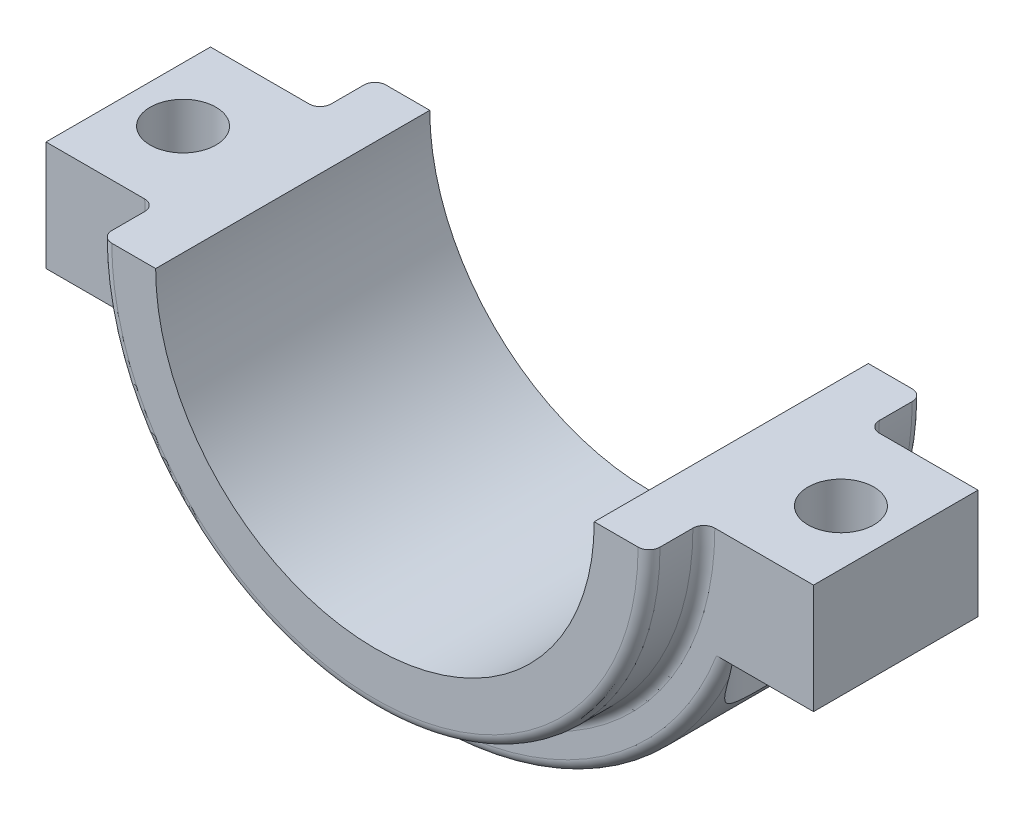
ISO-10303-21;
HEADER;
FILE_DESCRIPTION(('STEP AP214'),'2;1');
FILE_NAME('part.step','',(''),(''),'','','');
FILE_SCHEMA(('AUTOMOTIVE_DESIGN { 1 0 10303 214 1 1 1 1 }'));
ENDSEC;
DATA;
#1=APPLICATION_CONTEXT('core data for automotive mechanical design processes');
#2=APPLICATION_PROTOCOL_DEFINITION('international standard','automotive_design',2000,#1);
#3=PRODUCT_CONTEXT('',#1,'mechanical');
#4=PRODUCT('Part','Part','',(#3));
#5=PRODUCT_RELATED_PRODUCT_CATEGORY('part','',(#4));
#6=PRODUCT_DEFINITION_FORMATION('','',#4);
#7=PRODUCT_DEFINITION_CONTEXT('part definition',#1,'design');
#8=PRODUCT_DEFINITION('design','',#6,#7);
#9=PRODUCT_DEFINITION_SHAPE('','',#8);
#10=(LENGTH_UNIT() NAMED_UNIT(*) SI_UNIT(.MILLI.,.METRE.));
#11=(NAMED_UNIT(*) PLANE_ANGLE_UNIT() SI_UNIT($,.RADIAN.));
#12=(NAMED_UNIT(*) SI_UNIT($,.STERADIAN.) SOLID_ANGLE_UNIT());
#13=UNCERTAINTY_MEASURE_WITH_UNIT(LENGTH_MEASURE(1.E-05),#10,'distance_accuracy_value','');
#14=(GEOMETRIC_REPRESENTATION_CONTEXT(3) GLOBAL_UNCERTAINTY_ASSIGNED_CONTEXT((#13)) GLOBAL_UNIT_ASSIGNED_CONTEXT((#10,
#11,#12)) REPRESENTATION_CONTEXT('',''));
#15=CARTESIAN_POINT('',(0.,0.,0.));
#16=DIRECTION('',(0.,0.,1.));
#17=DIRECTION('',(1.,0.,0.));
#18=AXIS2_PLACEMENT_3D('',#15,#16,#17);
#19=CARTESIAN_POINT('',(54.4426303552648,-20.,15.));
#20=DIRECTION('',(0.,1.,0.));
#21=DIRECTION('',(0.,0.,1.));
#22=AXIS2_PLACEMENT_3D('',#19,#20,#21);
#23=PLANE('',#22);
#24=DIRECTION('',(1.,0.,0.));
#25=VECTOR('',#24,1.);
#26=CARTESIAN_POINT('',(54.4426303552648,-20.,15.));
#27=LINE('',#26,#25);
#28=CARTESIAN_POINT('',(52.3067873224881,-20.,15.));
#29=VERTEX_POINT('',#28);
#30=CARTESIAN_POINT('',(70.,-20.,15.));
#31=VERTEX_POINT('',#30);
#32=EDGE_CURVE('E250',#29,#31,#27,.T.);
#33=ORIENTED_EDGE('',*,*,#32,.F.);
#34=CARTESIAN_POINT('',(52.3067873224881,-20.,15.));
#35=CARTESIAN_POINT('',(52.3700881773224,-20.,14.9999972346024));
#36=CARTESIAN_POINT('',(52.4333600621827,-20.,14.997376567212));
#37=CARTESIAN_POINT('',(52.5594755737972,-20.,14.9868987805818));
#38=CARTESIAN_POINT('',(52.6223191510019,-20.,14.9790410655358));
#39=CARTESIAN_POINT('',(52.8096497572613,-20.,14.9476089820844));
#40=CARTESIAN_POINT('',(52.9329165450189,-20.,14.9161756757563));
#41=CARTESIAN_POINT('',(53.1724352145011,-20.,14.8328193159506));
#42=CARTESIAN_POINT('',(53.2886789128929,-20.,14.7808728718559));
#43=CARTESIAN_POINT('',(53.5103525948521,-20.,14.6574520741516));
#44=CARTESIAN_POINT('',(53.615784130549,-20.,14.5859805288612));
#45=CARTESIAN_POINT('',(53.8084524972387,-20.,14.4281082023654));
#46=CARTESIAN_POINT('',(53.8962112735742,-20.,14.3423443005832));
#47=CARTESIAN_POINT('',(54.0546887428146,-20.,14.1565322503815));
#48=CARTESIAN_POINT('',(54.125453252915,-20.,14.0565236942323));
#49=CARTESIAN_POINT('',(54.2053417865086,-20.,13.917909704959));
#50=CARTESIAN_POINT('',(54.2234243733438,-20.,13.8842994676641));
#51=CARTESIAN_POINT('',(54.2404837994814,-20.,13.8501975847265));
#52=B_SPLINE_CURVE_WITH_KNOTS('',3,(#34,#35,#36,#37,#38,#39,#40,#41,#42,#43,#44,#45,#46,#47,#48,
#49,#50,#51),.UNSPECIFIED.,.F.,.F.,(4,2,2,2,2,2,2,2,4),(0.,0.189789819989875,0.379601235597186,
0.759283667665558,1.1394002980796,1.51946228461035,1.88571346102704,2.25096583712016,
2.36539461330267),.UNSPECIFIED.);
#53=CARTESIAN_POINT('',(54.2404837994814,-20.,13.8501975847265));
#54=VERTEX_POINT('',#53);
#55=EDGE_CURVE('E387',#29,#54,#52,.T.);
#56=ORIENTED_EDGE('',*,*,#55,.T.);
#57=CARTESIAN_POINT('',(60.,-20.,0.));
#58=DIRECTION('',(0.,1.,0.));
#59=DIRECTION('',(0.,0.,-1.));
#60=AXIS2_PLACEMENT_3D('',#57,#58,#59);
#61=CIRCLE('',#60,15.);
#62=CARTESIAN_POINT('',(54.2404837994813,-20.,-13.8501975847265));
#63=VERTEX_POINT('',#62);
#64=EDGE_CURVE('E534',#63,#54,#61,.T.);
#65=ORIENTED_EDGE('',*,*,#64,.F.);
#66=CARTESIAN_POINT('',(54.2404837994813,-20.,-13.8501975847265));
#67=CARTESIAN_POINT('',(54.2148372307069,-20.,-13.9014357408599));
#68=CARTESIAN_POINT('',(54.1869381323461,-20.,-13.9515091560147));
#69=CARTESIAN_POINT('',(54.1269012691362,-20.,-14.0490229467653));
#70=CARTESIAN_POINT('',(54.09476505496,-20.,-14.0964642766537));
#71=CARTESIAN_POINT('',(53.9926488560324,-20.,-14.2340634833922));
#72=CARTESIAN_POINT('',(53.9167470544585,-20.,-14.3199205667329));
#73=CARTESIAN_POINT('',(53.7519658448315,-20.,-14.4777692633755));
#74=CARTESIAN_POINT('',(53.6631005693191,-20.,-14.5497757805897));
#75=CARTESIAN_POINT('',(53.4749332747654,-20.,-14.6787226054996));
#76=CARTESIAN_POINT('',(53.3756214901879,-20.,-14.7356486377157));
#77=CARTESIAN_POINT('',(53.164481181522,-20.,-14.8356863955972));
#78=CARTESIAN_POINT('',(53.0522821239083,-20.,-14.8780131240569));
#79=CARTESIAN_POINT('',(52.8226534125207,-20.,-14.9442627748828));
#80=CARTESIAN_POINT('',(52.7052289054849,-20.,-14.9682033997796));
#81=CARTESIAN_POINT('',(52.5402936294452,-20.,-14.9885500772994));
#82=CARTESIAN_POINT('',(52.4936476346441,-20.,-14.9928479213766));
#83=CARTESIAN_POINT('',(52.4002694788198,-20.,-14.9985690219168));
#84=CARTESIAN_POINT('',(52.3535376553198,-20.,-14.9999977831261));
#85=CARTESIAN_POINT('',(52.3067873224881,-20.,-15.));
#86=B_SPLINE_CURVE_WITH_KNOTS('',3,(#66,#67,#68,#69,#70,#71,#72,#73,#74,#75,#76,#77,#78,#79,#80,
#81,#82,#83,#84,#85),.UNSPECIFIED.,.F.,.F.,(4,2,2,2,2,2,2,2,2,4),(0.,0.171776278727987,
0.343489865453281,0.685510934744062,1.02716188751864,1.36913510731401,1.72735878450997,
2.08523712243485,2.22569885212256,2.36589082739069),.UNSPECIFIED.);
#87=CARTESIAN_POINT('',(52.3067873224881,-20.,-15.));
#88=VERTEX_POINT('',#87);
#89=EDGE_CURVE('E361',#63,#88,#86,.T.);
#90=ORIENTED_EDGE('',*,*,#89,.T.);
#91=DIRECTION('',(1.,0.,0.));
#92=VECTOR('',#91,1.);
#93=CARTESIAN_POINT('',(54.4426303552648,-20.,-15.));
#94=LINE('',#93,#92);
#95=CARTESIAN_POINT('',(70.,-20.,-15.));
#96=VERTEX_POINT('',#95);
#97=EDGE_CURVE('E61',#88,#96,#94,.T.);
#98=ORIENTED_EDGE('',*,*,#97,.T.);
#99=DIRECTION('',(0.,0.,-1.));
#100=VECTOR('',#99,1.);
#101=CARTESIAN_POINT('',(70.,-20.,15.));
#102=LINE('',#101,#100);
#103=EDGE_CURVE('E284',#31,#96,#102,.T.);
#104=ORIENTED_EDGE('',*,*,#103,.F.);
#105=EDGE_LOOP('',(#33,#56,#65,#90,#98,#104));
#106=FACE_BOUND('',#105,.T.);
#107=CARTESIAN_POINT('',(60.,-20.,0.));
#108=DIRECTION('',(0.,1.,0.));
#109=DIRECTION('',(0.,0.,-1.));
#110=AXIS2_PLACEMENT_3D('',#107,#108,#109);
#111=CIRCLE('',#110,6.);
#112=CARTESIAN_POINT('',(60.,-20.,-6.));
#113=VERTEX_POINT('',#112);
#114=EDGE_CURVE('E533',#113,#113,#111,.T.);
#115=ORIENTED_EDGE('',*,*,#114,.T.);
#116=EDGE_LOOP('',(#115));
#117=FACE_BOUND('',#116,.T.);
#118=ADVANCED_FACE('F45',(#106,#117),#23,.F.);
#119=CARTESIAN_POINT('',(40.,0.,15.));
#120=DIRECTION('',(0.,-1.,0.));
#121=DIRECTION('',(0.,0.,-1.));
#122=AXIS2_PLACEMENT_3D('',#119,#120,#121);
#123=PLANE('',#122);
#124=DIRECTION('',(-1.,0.,0.));
#125=VECTOR('',#124,1.);
#126=CARTESIAN_POINT('',(40.,0.,25.));
#127=LINE('',#126,#125);
#128=CARTESIAN_POINT('',(48.,0.,25.));
#129=VERTEX_POINT('',#128);
#130=CARTESIAN_POINT('',(40.,0.,25.));
#131=VERTEX_POINT('',#130);
#132=EDGE_CURVE('E207',#129,#131,#127,.T.);
#133=ORIENTED_EDGE('',*,*,#132,.F.);
#134=CARTESIAN_POINT('',(48.,0.,23.));
#135=DIRECTION('',(0.,-1.,0.));
#136=DIRECTION('',(0.,0.,-1.));
#137=AXIS2_PLACEMENT_3D('',#134,#135,#136);
#138=CIRCLE('',#137,2.);
#139=CARTESIAN_POINT('',(50.,0.,23.));
#140=VERTEX_POINT('',#139);
#141=EDGE_CURVE('E476',#129,#140,#138,.F.);
#142=ORIENTED_EDGE('',*,*,#141,.T.);
#143=DIRECTION('',(0.,0.,-1.));
#144=VECTOR('',#143,1.);
#145=CARTESIAN_POINT('',(50.,0.,25.));
#146=LINE('',#145,#144);
#147=CARTESIAN_POINT('',(50.,0.,17.));
#148=VERTEX_POINT('',#147);
#149=EDGE_CURVE('E234',#140,#148,#146,.T.);
#150=ORIENTED_EDGE('',*,*,#149,.T.);
#151=CARTESIAN_POINT('',(52.,0.,17.));
#152=DIRECTION('',(0.,-1.,0.));
#153=DIRECTION('',(0.,0.,-1.));
#154=AXIS2_PLACEMENT_3D('',#151,#152,#153);
#155=CIRCLE('',#154,2.);
#156=CARTESIAN_POINT('',(52.,0.,15.));
#157=VERTEX_POINT('',#156);
#158=EDGE_CURVE('E394',#148,#157,#155,.T.);
#159=ORIENTED_EDGE('',*,*,#158,.T.);
#160=DIRECTION('',(-1.,0.,0.));
#161=VECTOR('',#160,1.);
#162=CARTESIAN_POINT('',(40.,0.,15.));
#163=LINE('',#162,#161);
#164=CARTESIAN_POINT('',(70.,0.,15.));
#165=VERTEX_POINT('',#164);
#166=EDGE_CURVE('E256',#165,#157,#163,.T.);
#167=ORIENTED_EDGE('',*,*,#166,.F.);
#168=DIRECTION('',(0.,0.,-1.));
#169=VECTOR('',#168,1.);
#170=CARTESIAN_POINT('',(70.,0.,15.));
#171=LINE('',#170,#169);
#172=CARTESIAN_POINT('',(70.,0.,-15.));
#173=VERTEX_POINT('',#172);
#174=EDGE_CURVE('E280',#165,#173,#171,.T.);
#175=ORIENTED_EDGE('',*,*,#174,.T.);
#176=DIRECTION('',(-1.,0.,0.));
#177=VECTOR('',#176,1.);
#178=CARTESIAN_POINT('',(40.,0.,-15.));
#179=LINE('',#178,#177);
#180=CARTESIAN_POINT('',(52.,0.,-15.));
#181=VERTEX_POINT('',#180);
#182=EDGE_CURVE('E244',#173,#181,#179,.T.);
#183=ORIENTED_EDGE('',*,*,#182,.T.);
#184=CARTESIAN_POINT('',(52.,0.,-17.));
#185=DIRECTION('',(0.,-1.,0.));
#186=DIRECTION('',(0.,0.,-1.));
#187=AXIS2_PLACEMENT_3D('',#184,#185,#186);
#188=CIRCLE('',#187,2.);
#189=CARTESIAN_POINT('',(50.,0.,-17.));
#190=VERTEX_POINT('',#189);
#191=EDGE_CURVE('E11',#181,#190,#188,.T.);
#192=ORIENTED_EDGE('',*,*,#191,.T.);
#193=CARTESIAN_POINT('',(50.,0.,-23.));
#194=VERTEX_POINT('',#193);
#195=EDGE_CURVE('E225',#190,#194,#146,.T.);
#196=ORIENTED_EDGE('',*,*,#195,.T.);
#197=CARTESIAN_POINT('',(48.,0.,-23.));
#198=DIRECTION('',(0.,-1.,0.));
#199=DIRECTION('',(0.,0.,-1.));
#200=AXIS2_PLACEMENT_3D('',#197,#198,#199);
#201=CIRCLE('',#200,2.);
#202=CARTESIAN_POINT('',(48.,0.,-25.));
#203=VERTEX_POINT('',#202);
#204=EDGE_CURVE('E473',#194,#203,#201,.F.);
#205=ORIENTED_EDGE('',*,*,#204,.T.);
#206=DIRECTION('',(-1.,0.,0.));
#207=VECTOR('',#206,1.);
#208=CARTESIAN_POINT('',(40.,0.,-25.));
#209=LINE('',#208,#207);
#210=CARTESIAN_POINT('',(40.,0.,-25.));
#211=VERTEX_POINT('',#210);
#212=EDGE_CURVE('E213',#203,#211,#209,.T.);
#213=ORIENTED_EDGE('',*,*,#212,.T.);
#214=DIRECTION('',(0.,0.,-1.));
#215=VECTOR('',#214,1.);
#216=CARTESIAN_POINT('',(40.,0.,15.));
#217=LINE('',#216,#215);
#218=EDGE_CURVE('E260',#131,#211,#217,.T.);
#219=ORIENTED_EDGE('',*,*,#218,.F.);
#220=EDGE_LOOP('',(#133,#142,#150,#159,#167,#175,#183,#192,#196,#205,#213,#219));
#221=FACE_BOUND('',#220,.T.);
#222=CARTESIAN_POINT('',(60.,0.,0.));
#223=DIRECTION('',(0.,1.,0.));
#224=DIRECTION('',(0.,0.,-1.));
#225=AXIS2_PLACEMENT_3D('',#222,#223,#224);
#226=CIRCLE('',#225,6.);
#227=CARTESIAN_POINT('',(60.,0.,-6.));
#228=VERTEX_POINT('',#227);
#229=EDGE_CURVE('E436',#228,#228,#226,.T.);
#230=ORIENTED_EDGE('',*,*,#229,.F.);
#231=EDGE_LOOP('',(#230));
#232=FACE_BOUND('',#231,.T.);
#233=ADVANCED_FACE('F382',(#221,#232),#123,.F.);
#234=CARTESIAN_POINT('',(0.,0.,15.));
#235=DIRECTION('',(0.,0.,-1.));
#236=DIRECTION('',(-1.,0.,0.));
#237=AXIS2_PLACEMENT_3D('',#234,#235,#236);
#238=CYLINDRICAL_SURFACE('',#237,58.);
#239=CARTESIAN_POINT('',(54.4426303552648,-20.,-13.9325389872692));
#240=CARTESIAN_POINT('',(54.2736709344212,-20.4599693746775,-13.8651048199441));
#241=CARTESIAN_POINT('',(54.0991111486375,-20.9170965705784,-13.7919514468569));
#242=CARTESIAN_POINT('',(53.7392694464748,-21.8249631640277,-13.632399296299));
#243=CARTESIAN_POINT('',(53.5539836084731,-22.275700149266,-13.5459956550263));
#244=CARTESIAN_POINT('',(53.1719658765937,-23.1728610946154,-13.3575279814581));
#245=CARTESIAN_POINT('',(52.9751631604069,-23.6192330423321,-13.25535892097));
#246=CARTESIAN_POINT('',(52.5720869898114,-24.5032979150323,-13.0337647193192));
#247=CARTESIAN_POINT('',(52.365814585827,-24.9409917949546,-12.9143414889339));
#248=CARTESIAN_POINT('',(51.9409541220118,-25.8142845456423,-12.6536563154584));
#249=CARTESIAN_POINT('',(51.7222108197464,-26.249702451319,-12.5120385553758));
#250=CARTESIAN_POINT('',(51.2772276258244,-27.1086678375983,-12.2059894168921));
#251=CARTESIAN_POINT('',(51.0509866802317,-27.5322136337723,-12.0415548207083));
#252=CARTESIAN_POINT('',(50.5935040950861,-28.3640965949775,-11.6876525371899));
#253=CARTESIAN_POINT('',(50.3622796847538,-28.7724759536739,-11.4982622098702));
#254=CARTESIAN_POINT('',(49.8965249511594,-29.5728074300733,-11.0912310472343));
#255=CARTESIAN_POINT('',(49.6619960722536,-29.9647664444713,-10.8736022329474));
#256=CARTESIAN_POINT('',(49.2473933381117,-30.640048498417,-10.4616303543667));
#257=CARTESIAN_POINT('',(49.0674010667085,-30.9273543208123,-10.2737296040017));
#258=CARTESIAN_POINT('',(48.708791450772,-31.4891192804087,-9.87825245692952));
#259=CARTESIAN_POINT('',(48.5301742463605,-31.7635771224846,-9.67067408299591));
#260=CARTESIAN_POINT('',(48.1768207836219,-32.2969966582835,-9.23530169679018));
#261=CARTESIAN_POINT('',(48.0020747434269,-32.5560011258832,-9.00756827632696));
#262=CARTESIAN_POINT('',(47.6582399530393,-33.0572916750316,-8.53038255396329));
#263=CARTESIAN_POINT('',(47.4891510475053,-33.2995782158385,-8.28093084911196));
#264=CARTESIAN_POINT('',(47.1570564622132,-33.7682636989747,-7.75606461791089));
#265=CARTESIAN_POINT('',(46.9941652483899,-33.9944007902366,-7.48034231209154));
#266=CARTESIAN_POINT('',(46.6801670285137,-34.424306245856,-6.90573494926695));
#267=CARTESIAN_POINT('',(46.5290570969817,-34.6280801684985,-6.60685567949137));
#268=CARTESIAN_POINT('',(46.2422496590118,-35.0101610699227,-5.98672460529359));
#269=CARTESIAN_POINT('',(46.1065352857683,-35.1884959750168,-5.66549791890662));
#270=CARTESIAN_POINT('',(45.854069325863,-35.51685883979,-5.0018497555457));
#271=CARTESIAN_POINT('',(45.7373092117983,-35.6668995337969,-4.65943790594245));
#272=CARTESIAN_POINT('',(45.5568083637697,-35.8969636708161,-4.05741105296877));
#273=CARTESIAN_POINT('',(45.4874868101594,-35.9847022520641,-3.80238536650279));
#274=CARTESIAN_POINT('',(45.3615064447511,-36.1433812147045,-3.2841374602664));
#275=CARTESIAN_POINT('',(45.3048445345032,-36.2143257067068,-3.02091726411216));
#276=CARTESIAN_POINT('',(45.205275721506,-36.3385386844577,-2.48789319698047));
#277=CARTESIAN_POINT('',(45.1623631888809,-36.3918144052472,-2.21809206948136));
#278=CARTESIAN_POINT('',(45.091127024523,-36.4800423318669,-1.67358565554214));
#279=CARTESIAN_POINT('',(45.0628039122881,-36.5149938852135,-1.39888019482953));
#280=CARTESIAN_POINT('',(45.0212896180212,-36.5661671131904,-0.845789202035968));
#281=CARTESIAN_POINT('',(45.0081419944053,-36.5823348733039,-0.567395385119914));
#282=CARTESIAN_POINT('',(44.9974121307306,-36.5955321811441,-0.00985383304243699));
#283=CARTESIAN_POINT('',(44.9998298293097,-36.5925618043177,0.269293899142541));
#284=CARTESIAN_POINT('',(45.0201772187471,-36.5675252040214,0.826161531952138));
#285=CARTESIAN_POINT('',(45.0381070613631,-36.545458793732,1.10388141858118));
#286=CARTESIAN_POINT('',(45.0890905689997,-36.4825375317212,1.6557704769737));
#287=CARTESIAN_POINT('',(45.1221440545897,-36.4416829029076,1.92993969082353));
#288=CARTESIAN_POINT('',(45.2010301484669,-36.3437841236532,2.46165852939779));
#289=CARTESIAN_POINT('',(45.2462851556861,-36.2874700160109,2.71942939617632));
#290=CARTESIAN_POINT('',(45.3492269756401,-36.1587388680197,3.22835112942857));
#291=CARTESIAN_POINT('',(45.4069130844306,-36.0863227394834,3.47950236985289));
#292=CARTESIAN_POINT('',(45.5337337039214,-35.926167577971,3.9739525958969));
#293=CARTESIAN_POINT('',(45.60287080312,-35.8384250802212,4.21724979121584));
#294=CARTESIAN_POINT('',(45.7514781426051,-35.6485172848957,4.69491468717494));
#295=CARTESIAN_POINT('',(45.8309504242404,-35.546349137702,4.92928061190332));
#296=CARTESIAN_POINT('',(46.0269340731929,-35.2924193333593,5.46436532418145));
#297=CARTESIAN_POINT('',(46.1469907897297,-35.135444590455,5.76132668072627));
#298=CARTESIAN_POINT('',(46.400554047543,-34.799896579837,6.33671884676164));
#299=CARTESIAN_POINT('',(46.534064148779,-34.6213175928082,6.61514471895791));
#300=CARTESIAN_POINT('',(46.8118908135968,-34.2447313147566,7.1530026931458));
#301=CARTESIAN_POINT('',(46.9562131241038,-34.0467136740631,7.41242454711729));
#302=CARTESIAN_POINT('',(47.253122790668,-33.6334239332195,7.91211936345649));
#303=CARTESIAN_POINT('',(47.4057124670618,-33.4181469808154,8.15238690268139));
#304=CARTESIAN_POINT('',(47.7809115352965,-32.8805629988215,8.70909298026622));
#305=CARTESIAN_POINT('',(48.0065031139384,-32.5506570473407,9.01620709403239));
#306=CARTESIAN_POINT('',(48.4642146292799,-31.8651843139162,9.59488842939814));
#307=CARTESIAN_POINT('',(48.6963374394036,-31.5096061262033,9.86643969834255));
#308=CARTESIAN_POINT('',(49.1640289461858,-30.7748116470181,10.3779824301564));
#309=CARTESIAN_POINT('',(49.3996098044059,-30.3954706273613,10.6177824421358));
#310=CARTESIAN_POINT('',(49.8693379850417,-29.6184944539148,11.0668543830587));
#311=CARTESIAN_POINT('',(50.1034855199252,-29.2208620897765,11.2761309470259));
#312=CARTESIAN_POINT('',(50.5298173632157,-28.476140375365,11.6352963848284));
#313=CARTESIAN_POINT('',(50.722622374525,-28.1313731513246,11.7893056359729));
#314=CARTESIAN_POINT('',(51.1041164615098,-27.432241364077,12.079765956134));
#315=CARTESIAN_POINT('',(51.2928049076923,-27.0778753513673,12.2162143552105));
#316=CARTESIAN_POINT('',(51.6652432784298,-26.3603161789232,12.4732951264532));
#317=CARTESIAN_POINT('',(51.8489867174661,-25.9971125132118,12.5939074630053));
#318=CARTESIAN_POINT('',(52.2104817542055,-25.26327200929,12.8206445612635));
#319=CARTESIAN_POINT('',(52.3882330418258,-24.892634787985,12.9267685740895));
#320=CARTESIAN_POINT('',(52.7335014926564,-24.1524567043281,13.1238980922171));
#321=CARTESIAN_POINT('',(52.9011537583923,-23.783049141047,13.2151689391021));
#322=CARTESIAN_POINT('',(53.2295876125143,-23.0385883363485,13.3864036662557));
#323=CARTESIAN_POINT('',(53.3903688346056,-22.663534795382,13.4663669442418));
#324=CARTESIAN_POINT('',(53.7041466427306,-21.909604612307,13.6158868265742));
#325=CARTESIAN_POINT('',(53.8571665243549,-21.5307440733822,13.6854759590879));
#326=CARTESIAN_POINT('',(54.1556398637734,-20.7685899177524,13.8155638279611));
#327=CARTESIAN_POINT('',(54.3010947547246,-20.3852971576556,13.8760642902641));
#328=CARTESIAN_POINT('',(54.4426303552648,-20.,13.9325389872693));
#329=B_SPLINE_CURVE_WITH_KNOTS('',3,(#239,#240,#241,#242,#243,#244,#245,#246,#247,#248,#249,
#250,#251,#252,#253,#254,#255,#256,#257,#258,#259,#260,#261,#262,#263,#264,#265,#266,#267,#268,
#269,#270,#271,#272,#273,#274,#275,#276,#277,#278,#279,#280,#281,#282,#283,#284,#285,#286,#287,
#288,#289,#290,#291,#292,#293,#294,#295,#296,#297,#298,#299,#300,#301,#302,#303,#304,#305,#306,
#307,#308,#309,#310,#311,#312,#313,#314,#315,#316,#317,#318,#319,#320,#321,#322,#323,#324,#325,
#326,#327,#328),.UNSPECIFIED.,.F.,.F.,(4,2,2,2,2,2,2,2,2,2,2,2,2,2,2,2,2,2,2,2,2,2,2,2,2,2,2,2,
2,2,2,2,2,2,2,2,2,2,2,2,2,2,2,2,4),(0.,1.48391457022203,2.9683751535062,4.46318990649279,
5.95783924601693,7.47951277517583,9.00140111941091,10.5186781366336,12.0353113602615,
13.1975413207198,14.3598881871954,15.5188522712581,16.6777845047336,17.8525280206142,
19.026978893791,20.2001303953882,21.3727526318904,22.2073136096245,23.0416701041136,
23.8756845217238,24.7097286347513,25.5461608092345,26.3825896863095,27.2190267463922,
28.055453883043,28.857690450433,29.6598816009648,30.4622543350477,31.2647857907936,
32.3333420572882,33.4021818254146,34.4715937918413,35.5413074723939,37.0510652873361,
38.5614980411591,40.0806594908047,41.5995900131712,42.8710127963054,44.1426286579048,
45.4158381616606,46.6891134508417,47.9362853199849,49.1835235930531,50.4267649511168,
51.6697699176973),.UNSPECIFIED.);
#330=CARTESIAN_POINT('',(52.5166852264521,-24.617022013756,-13.));
#331=VERTEX_POINT('',#330);
#332=CARTESIAN_POINT('',(52.5166852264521,-24.617022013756,13.));
#333=VERTEX_POINT('',#332);
#334=EDGE_CURVE('E525',#331,#333,#329,.T.);
#335=ORIENTED_EDGE('',*,*,#334,.T.);
#336=CARTESIAN_POINT('',(0.,0.,13.));
#337=DIRECTION('',(0.,0.,1.));
#338=DIRECTION('',(1.,0.,0.));
#339=AXIS2_PLACEMENT_3D('',#336,#337,#338);
#340=CIRCLE('',#339,58.);
#341=CARTESIAN_POINT('',(-52.5166852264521,-24.617022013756,13.));
#342=VERTEX_POINT('',#341);
#343=EDGE_CURVE('E332',#333,#342,#340,.F.);
#344=ORIENTED_EDGE('',*,*,#343,.T.);
#345=CARTESIAN_POINT('',(-54.4426303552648,-20.,-13.9325389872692));
#346=CARTESIAN_POINT('',(-54.2736709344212,-20.4599693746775,-13.8651048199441));
#347=CARTESIAN_POINT('',(-54.0991111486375,-20.9170965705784,-13.7919514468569));
#348=CARTESIAN_POINT('',(-53.7392694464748,-21.8249631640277,-13.632399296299));
#349=CARTESIAN_POINT('',(-53.5539836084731,-22.275700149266,-13.5459956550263));
#350=CARTESIAN_POINT('',(-53.1719658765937,-23.1728610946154,-13.3575279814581));
#351=CARTESIAN_POINT('',(-52.9751631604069,-23.6192330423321,-13.25535892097));
#352=CARTESIAN_POINT('',(-52.5720869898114,-24.5032979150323,-13.0337647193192));
#353=CARTESIAN_POINT('',(-52.365814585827,-24.9409917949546,-12.9143414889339));
#354=CARTESIAN_POINT('',(-51.9409541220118,-25.8142845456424,-12.6536563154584));
#355=CARTESIAN_POINT('',(-51.7222108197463,-26.249702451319,-12.5120385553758));
#356=CARTESIAN_POINT('',(-51.2772276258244,-27.1086678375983,-12.2059894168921));
#357=CARTESIAN_POINT('',(-51.0509866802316,-27.5322136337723,-12.0415548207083));
#358=CARTESIAN_POINT('',(-50.5935040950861,-28.3640965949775,-11.6876525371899));
#359=CARTESIAN_POINT('',(-50.3622796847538,-28.7724759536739,-11.4982622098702));
#360=CARTESIAN_POINT('',(-49.8965249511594,-29.5728074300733,-11.0912310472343));
#361=CARTESIAN_POINT('',(-49.6619960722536,-29.9647664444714,-10.8736022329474));
#362=CARTESIAN_POINT('',(-49.2473933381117,-30.640048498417,-10.4616303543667));
#363=CARTESIAN_POINT('',(-49.0674010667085,-30.9273543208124,-10.2737296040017));
#364=CARTESIAN_POINT('',(-48.708791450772,-31.4891192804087,-9.87825245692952));
#365=CARTESIAN_POINT('',(-48.5301742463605,-31.7635771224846,-9.67067408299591));
#366=CARTESIAN_POINT('',(-48.1768207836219,-32.2969966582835,-9.23530169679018));
#367=CARTESIAN_POINT('',(-48.0020747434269,-32.5560011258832,-9.00756827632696));
#368=CARTESIAN_POINT('',(-47.6582399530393,-33.0572916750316,-8.53038255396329));
#369=CARTESIAN_POINT('',(-47.4891510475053,-33.2995782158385,-8.28093084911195));
#370=CARTESIAN_POINT('',(-47.1570564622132,-33.7682636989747,-7.75606461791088));
#371=CARTESIAN_POINT('',(-46.9941652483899,-33.9944007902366,-7.48034231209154));
#372=CARTESIAN_POINT('',(-46.6801670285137,-34.424306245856,-6.90573494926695));
#373=CARTESIAN_POINT('',(-46.5290570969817,-34.6280801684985,-6.60685567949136));
#374=CARTESIAN_POINT('',(-46.2422496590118,-35.0101610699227,-5.98672460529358));
#375=CARTESIAN_POINT('',(-46.1065352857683,-35.1884959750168,-5.66549791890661));
#376=CARTESIAN_POINT('',(-45.854069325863,-35.51685883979,-5.00184975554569));
#377=CARTESIAN_POINT('',(-45.7373092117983,-35.6668995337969,-4.65943790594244));
#378=CARTESIAN_POINT('',(-45.5568083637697,-35.8969636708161,-4.05741105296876));
#379=CARTESIAN_POINT('',(-45.4874868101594,-35.984702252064,-3.80238536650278));
#380=CARTESIAN_POINT('',(-45.3615064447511,-36.1433812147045,-3.28413746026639));
#381=CARTESIAN_POINT('',(-45.3048445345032,-36.2143257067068,-3.02091726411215));
#382=CARTESIAN_POINT('',(-45.205275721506,-36.3385386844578,-2.48789319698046));
#383=CARTESIAN_POINT('',(-45.1623631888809,-36.3918144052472,-2.21809206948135));
#384=CARTESIAN_POINT('',(-45.091127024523,-36.4800423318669,-1.67358565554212));
#385=CARTESIAN_POINT('',(-45.0628039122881,-36.5149938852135,-1.39888019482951));
#386=CARTESIAN_POINT('',(-45.0212896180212,-36.5661671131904,-0.845789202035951));
#387=CARTESIAN_POINT('',(-45.0081419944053,-36.5823348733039,-0.567395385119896));
#388=CARTESIAN_POINT('',(-44.9974121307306,-36.5955321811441,-0.00985383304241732));
#389=CARTESIAN_POINT('',(-44.9998298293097,-36.5925618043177,0.269293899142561));
#390=CARTESIAN_POINT('',(-45.0201772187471,-36.5675252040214,0.826161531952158));
#391=CARTESIAN_POINT('',(-45.0381070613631,-36.545458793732,1.1038814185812));
#392=CARTESIAN_POINT('',(-45.0890905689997,-36.4825375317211,1.65577047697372));
#393=CARTESIAN_POINT('',(-45.1221440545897,-36.4416829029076,1.92993969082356));
#394=CARTESIAN_POINT('',(-45.2010301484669,-36.3437841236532,2.46165852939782));
#395=CARTESIAN_POINT('',(-45.2462851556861,-36.2874700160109,2.71942939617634));
#396=CARTESIAN_POINT('',(-45.3492269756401,-36.1587388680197,3.22835112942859));
#397=CARTESIAN_POINT('',(-45.4069130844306,-36.0863227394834,3.47950236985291));
#398=CARTESIAN_POINT('',(-45.5337337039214,-35.926167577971,3.97395259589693));
#399=CARTESIAN_POINT('',(-45.60287080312,-35.8384250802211,4.21724979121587));
#400=CARTESIAN_POINT('',(-45.7514781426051,-35.6485172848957,4.69491468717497));
#401=CARTESIAN_POINT('',(-45.8309504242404,-35.546349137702,4.92928061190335));
#402=CARTESIAN_POINT('',(-46.0269340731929,-35.2924193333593,5.46436532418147));
#403=CARTESIAN_POINT('',(-46.1469907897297,-35.135444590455,5.76132668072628));
#404=CARTESIAN_POINT('',(-46.400554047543,-34.7998965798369,6.33671884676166));
#405=CARTESIAN_POINT('',(-46.534064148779,-34.6213175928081,6.61514471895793));
#406=CARTESIAN_POINT('',(-46.8118908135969,-34.2447313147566,7.15300269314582));
#407=CARTESIAN_POINT('',(-46.9562131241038,-34.0467136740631,7.4124245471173));
#408=CARTESIAN_POINT('',(-47.253122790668,-33.6334239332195,7.91211936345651));
#409=CARTESIAN_POINT('',(-47.4057124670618,-33.4181469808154,8.15238690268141));
#410=CARTESIAN_POINT('',(-47.7809115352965,-32.8805629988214,8.70909298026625));
#411=CARTESIAN_POINT('',(-48.0065031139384,-32.5506570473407,9.01620709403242));
#412=CARTESIAN_POINT('',(-48.4642146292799,-31.8651843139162,9.59488842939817));
#413=CARTESIAN_POINT('',(-48.6963374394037,-31.5096061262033,9.86643969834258));
#414=CARTESIAN_POINT('',(-49.1640289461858,-30.774811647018,10.3779824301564));
#415=CARTESIAN_POINT('',(-49.399609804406,-30.3954706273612,10.6177824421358));
#416=CARTESIAN_POINT('',(-49.8693379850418,-29.6184944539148,11.0668543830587));
#417=CARTESIAN_POINT('',(-50.1034855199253,-29.2208620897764,11.2761309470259));
#418=CARTESIAN_POINT('',(-50.5298173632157,-28.476140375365,11.6352963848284));
#419=CARTESIAN_POINT('',(-50.722622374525,-28.1313731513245,11.789305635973));
#420=CARTESIAN_POINT('',(-51.1041164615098,-27.432241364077,12.079765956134));
#421=CARTESIAN_POINT('',(-51.2928049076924,-27.0778753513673,12.2162143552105));
#422=CARTESIAN_POINT('',(-51.6652432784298,-26.3603161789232,12.4732951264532));
#423=CARTESIAN_POINT('',(-51.8489867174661,-25.9971125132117,12.5939074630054));
#424=CARTESIAN_POINT('',(-52.2104817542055,-25.26327200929,12.8206445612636));
#425=CARTESIAN_POINT('',(-52.3882330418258,-24.8926347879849,12.9267685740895));
#426=CARTESIAN_POINT('',(-52.7335014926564,-24.1524567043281,13.1238980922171));
#427=CARTESIAN_POINT('',(-52.9011537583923,-23.783049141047,13.2151689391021));
#428=CARTESIAN_POINT('',(-53.2295876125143,-23.0385883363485,13.3864036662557));
#429=CARTESIAN_POINT('',(-53.3903688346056,-22.663534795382,13.4663669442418));
#430=CARTESIAN_POINT('',(-53.7041466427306,-21.909604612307,13.6158868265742));
#431=CARTESIAN_POINT('',(-53.8571665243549,-21.5307440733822,13.6854759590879));
#432=CARTESIAN_POINT('',(-54.1556398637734,-20.7685899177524,13.8155638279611));
#433=CARTESIAN_POINT('',(-54.3010947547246,-20.3852971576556,13.8760642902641));
#434=CARTESIAN_POINT('',(-54.4426303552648,-20.0000000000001,13.9325389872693));
#435=B_SPLINE_CURVE_WITH_KNOTS('',3,(#345,#346,#347,#348,#349,#350,#351,#352,#353,#354,#355,
#356,#357,#358,#359,#360,#361,#362,#363,#364,#365,#366,#367,#368,#369,#370,#371,#372,#373,#374,
#375,#376,#377,#378,#379,#380,#381,#382,#383,#384,#385,#386,#387,#388,#389,#390,#391,#392,#393,
#394,#395,#396,#397,#398,#399,#400,#401,#402,#403,#404,#405,#406,#407,#408,#409,#410,#411,#412,
#413,#414,#415,#416,#417,#418,#419,#420,#421,#422,#423,#424,#425,#426,#427,#428,#429,#430,#431,
#432,#433,#434),.UNSPECIFIED.,.F.,.F.,(4,2,2,2,2,2,2,2,2,2,2,2,2,2,2,2,2,2,2,2,2,2,2,2,2,2,2,2,
2,2,2,2,2,2,2,2,2,2,2,2,2,2,2,2,4),(0.,1.48391457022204,2.96837515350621,4.46318990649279,
5.95783924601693,7.47951277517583,9.00140111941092,10.5186781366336,12.0353113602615,
13.1975413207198,14.3598881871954,15.5188522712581,16.6777845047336,17.8525280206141,
19.026978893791,20.2001303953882,21.3727526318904,22.2073136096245,23.0416701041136,
23.8756845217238,24.7097286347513,25.5461608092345,26.3825896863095,27.2190267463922,
28.055453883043,28.857690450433,29.6598816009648,30.4622543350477,31.2647857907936,
32.3333420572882,33.4021818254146,34.4715937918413,35.5413074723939,37.0510652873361,
38.5614980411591,40.0806594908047,41.5995900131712,42.8710127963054,44.1426286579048,
45.4158381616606,46.6891134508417,47.9362853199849,49.1835235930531,50.4267649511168,
51.6697699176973),.UNSPECIFIED.);
#436=CARTESIAN_POINT('',(-52.5166852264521,-24.617022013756,-13.));
#437=VERTEX_POINT('',#436);
#438=EDGE_CURVE('E194',#437,#342,#435,.T.);
#439=ORIENTED_EDGE('',*,*,#438,.F.);
#440=CARTESIAN_POINT('',(0.,0.,-13.));
#441=DIRECTION('',(0.,0.,1.));
#442=DIRECTION('',(1.,0.,0.));
#443=AXIS2_PLACEMENT_3D('',#440,#441,#442);
#444=CIRCLE('',#443,58.);
#445=EDGE_CURVE('E508',#437,#331,#444,.T.);
#446=ORIENTED_EDGE('',*,*,#445,.T.);
#447=EDGE_LOOP('',(#335,#344,#439,#446));
#448=FACE_BOUND('',#447,.T.);
#449=ADVANCED_FACE('F305',(#448),#238,.T.);
#450=CARTESIAN_POINT('',(0.,0.,15.));
#451=DIRECTION('',(0.,0.,1.));
#452=DIRECTION('',(1.,0.,0.));
#453=AXIS2_PLACEMENT_3D('',#450,#451,#452);
#454=PLANE('',#453);
#455=ORIENTED_EDGE('',*,*,#166,.T.);
#456=CARTESIAN_POINT('',(0.,0.,15.));
#457=DIRECTION('',(0.,0.,1.));
#458=DIRECTION('',(1.,0.,0.));
#459=AXIS2_PLACEMENT_3D('',#456,#457,#458);
#460=CIRCLE('',#459,52.);
#461=CARTESIAN_POINT('',(-52.,0.,15.));
#462=VERTEX_POINT('',#461);
#463=EDGE_CURVE('E493',#157,#462,#460,.F.);
#464=ORIENTED_EDGE('',*,*,#463,.T.);
#465=DIRECTION('',(-1.,0.,0.));
#466=VECTOR('',#465,1.);
#467=CARTESIAN_POINT('',(-70.,0.,15.));
#468=LINE('',#467,#466);
#469=CARTESIAN_POINT('',(-70.,0.,15.));
#470=VERTEX_POINT('',#469);
#471=EDGE_CURVE('E240',#462,#470,#468,.T.);
#472=ORIENTED_EDGE('',*,*,#471,.T.);
#473=DIRECTION('',(0.,-1.,0.));
#474=VECTOR('',#473,1.);
#475=CARTESIAN_POINT('',(-70.,0.,15.));
#476=LINE('',#475,#474);
#477=CARTESIAN_POINT('',(-70.,-20.,15.));
#478=VERTEX_POINT('',#477);
#479=EDGE_CURVE('E243',#470,#478,#476,.T.);
#480=ORIENTED_EDGE('',*,*,#479,.T.);
#481=DIRECTION('',(1.,0.,0.));
#482=VECTOR('',#481,1.);
#483=CARTESIAN_POINT('',(-70.,-20.,15.));
#484=LINE('',#483,#482);
#485=CARTESIAN_POINT('',(-52.3067873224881,-20.,15.));
#486=VERTEX_POINT('',#485);
#487=EDGE_CURVE('E247',#478,#486,#484,.T.);
#488=ORIENTED_EDGE('',*,*,#487,.T.);
#489=CARTESIAN_POINT('',(0.,0.,15.));
#490=DIRECTION('',(0.,0.,1.));
#491=DIRECTION('',(1.,0.,0.));
#492=AXIS2_PLACEMENT_3D('',#489,#490,#491);
#493=CIRCLE('',#492,56.);
#494=EDGE_CURVE('E440',#486,#29,#493,.T.);
#495=ORIENTED_EDGE('',*,*,#494,.T.);
#496=ORIENTED_EDGE('',*,*,#32,.T.);
#497=DIRECTION('',(0.,1.,0.));
#498=VECTOR('',#497,1.);
#499=CARTESIAN_POINT('',(70.,0.,15.));
#500=LINE('',#499,#498);
#501=EDGE_CURVE('E253',#31,#165,#500,.T.);
#502=ORIENTED_EDGE('',*,*,#501,.T.);
#503=EDGE_LOOP('',(#455,#464,#472,#480,#488,#495,#496,#502));
#504=FACE_BOUND('',#503,.T.);
#505=ADVANCED_FACE('F581',(#504),#454,.T.);
#506=CARTESIAN_POINT('',(0.,0.,-15.));
#507=DIRECTION('',(0.,0.,1.));
#508=DIRECTION('',(1.,0.,0.));
#509=AXIS2_PLACEMENT_3D('',#506,#507,#508);
#510=PLANE('',#509);
#511=ORIENTED_EDGE('',*,*,#97,.F.);
#512=CARTESIAN_POINT('',(0.,0.,-15.));
#513=DIRECTION('',(0.,0.,1.));
#514=DIRECTION('',(1.,0.,0.));
#515=AXIS2_PLACEMENT_3D('',#512,#513,#514);
#516=CIRCLE('',#515,56.);
#517=CARTESIAN_POINT('',(-52.3067873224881,-20.,-15.));
#518=VERTEX_POINT('',#517);
#519=EDGE_CURVE('E411',#88,#518,#516,.F.);
#520=ORIENTED_EDGE('',*,*,#519,.T.);
#521=DIRECTION('',(1.,0.,0.));
#522=VECTOR('',#521,1.);
#523=CARTESIAN_POINT('',(-70.,-20.,-15.));
#524=LINE('',#523,#522);
#525=CARTESIAN_POINT('',(-70.,-20.,-15.));
#526=VERTEX_POINT('',#525);
#527=EDGE_CURVE('E69',#526,#518,#524,.T.);
#528=ORIENTED_EDGE('',*,*,#527,.F.);
#529=DIRECTION('',(0.,-1.,0.));
#530=VECTOR('',#529,1.);
#531=CARTESIAN_POINT('',(-70.,0.,-15.));
#532=LINE('',#531,#530);
#533=CARTESIAN_POINT('',(-70.,0.,-15.));
#534=VERTEX_POINT('',#533);
#535=EDGE_CURVE('E264',#534,#526,#532,.T.);
#536=ORIENTED_EDGE('',*,*,#535,.F.);
#537=DIRECTION('',(-1.,0.,0.));
#538=VECTOR('',#537,1.);
#539=CARTESIAN_POINT('',(-70.,0.,-15.));
#540=LINE('',#539,#538);
#541=CARTESIAN_POINT('',(-52.,0.,-15.));
#542=VERTEX_POINT('',#541);
#543=EDGE_CURVE('E261',#542,#534,#540,.T.);
#544=ORIENTED_EDGE('',*,*,#543,.F.);
#545=CARTESIAN_POINT('',(0.,0.,-15.));
#546=DIRECTION('',(0.,0.,1.));
#547=DIRECTION('',(1.,0.,0.));
#548=AXIS2_PLACEMENT_3D('',#545,#546,#547);
#549=CIRCLE('',#548,52.);
#550=EDGE_CURVE('E413',#542,#181,#549,.T.);
#551=ORIENTED_EDGE('',*,*,#550,.T.);
#552=ORIENTED_EDGE('',*,*,#182,.F.);
#553=DIRECTION('',(0.,1.,0.));
#554=VECTOR('',#553,1.);
#555=CARTESIAN_POINT('',(70.,0.,-15.));
#556=LINE('',#555,#554);
#557=EDGE_CURVE('E272',#96,#173,#556,.T.);
#558=ORIENTED_EDGE('',*,*,#557,.F.);
#559=EDGE_LOOP('',(#511,#520,#528,#536,#544,#551,#552,#558));
#560=FACE_BOUND('',#559,.T.);
#561=ADVANCED_FACE('F461',(#560),#510,.F.);
#562=CARTESIAN_POINT('',(0.,0.,15.));
#563=DIRECTION('',(0.,0.,-1.));
#564=DIRECTION('',(-1.,0.,0.));
#565=AXIS2_PLACEMENT_3D('',#562,#563,#564);
#566=CYLINDRICAL_SURFACE('',#565,40.);
#567=ORIENTED_EDGE('',*,*,#218,.T.);
#568=CARTESIAN_POINT('',(0.,0.,-25.));
#569=DIRECTION('',(0.,0.,-1.));
#570=DIRECTION('',(1.,0.,0.));
#571=AXIS2_PLACEMENT_3D('',#568,#569,#570);
#572=CIRCLE('',#571,40.);
#573=CARTESIAN_POINT('',(-40.,0.,-25.));
#574=VERTEX_POINT('',#573);
#575=EDGE_CURVE('E189',#211,#574,#572,.T.);
#576=ORIENTED_EDGE('',*,*,#575,.T.);
#577=DIRECTION('',(0.,0.,-1.));
#578=VECTOR('',#577,1.);
#579=CARTESIAN_POINT('',(-40.,0.,15.));
#580=LINE('',#579,#578);
#581=CARTESIAN_POINT('',(-40.,0.,25.));
#582=VERTEX_POINT('',#581);
#583=EDGE_CURVE('E182',#582,#574,#580,.T.);
#584=ORIENTED_EDGE('',*,*,#583,.F.);
#585=CARTESIAN_POINT('',(0.,0.,25.));
#586=DIRECTION('',(0.,0.,-1.));
#587=DIRECTION('',(1.,0.,0.));
#588=AXIS2_PLACEMENT_3D('',#585,#586,#587);
#589=CIRCLE('',#588,40.);
#590=EDGE_CURVE('E187',#131,#582,#589,.T.);
#591=ORIENTED_EDGE('',*,*,#590,.F.);
#592=EDGE_LOOP('',(#567,#576,#584,#591));
#593=FACE_BOUND('',#592,.T.);
#594=ADVANCED_FACE('F185',(#593),#566,.F.);
#595=CARTESIAN_POINT('',(-70.,0.,15.));
#596=DIRECTION('',(0.,-1.,0.));
#597=DIRECTION('',(0.,0.,-1.));
#598=AXIS2_PLACEMENT_3D('',#595,#596,#597);
#599=PLANE('',#598);
#600=CARTESIAN_POINT('',(-60.,0.,0.));
#601=DIRECTION('',(0.,-1.,0.));
#602=DIRECTION('',(0.,0.,-1.));
#603=AXIS2_PLACEMENT_3D('',#600,#601,#602);
#604=CIRCLE('',#603,6.);
#605=CARTESIAN_POINT('',(-60.,0.,-6.));
#606=VERTEX_POINT('',#605);
#607=EDGE_CURVE('E228',#606,#606,#604,.T.);
#608=ORIENTED_EDGE('',*,*,#607,.T.);
#609=EDGE_LOOP('',(#608));
#610=FACE_BOUND('',#609,.T.);
#611=DIRECTION('',(0.,0.,-1.));
#612=VECTOR('',#611,1.);
#613=CARTESIAN_POINT('',(-50.,0.,25.));
#614=LINE('',#613,#612);
#615=CARTESIAN_POINT('',(-50.,0.,23.));
#616=VERTEX_POINT('',#615);
#617=CARTESIAN_POINT('',(-50.,0.,17.));
#618=VERTEX_POINT('',#617);
#619=EDGE_CURVE('E239',#616,#618,#614,.T.);
#620=ORIENTED_EDGE('',*,*,#619,.F.);
#621=CARTESIAN_POINT('',(-48.,0.,23.));
#622=DIRECTION('',(0.,-1.,0.));
#623=DIRECTION('',(0.,0.,-1.));
#624=AXIS2_PLACEMENT_3D('',#621,#622,#623);
#625=CIRCLE('',#624,2.);
#626=CARTESIAN_POINT('',(-48.,0.,25.));
#627=VERTEX_POINT('',#626);
#628=EDGE_CURVE('E202',#616,#627,#625,.F.);
#629=ORIENTED_EDGE('',*,*,#628,.T.);
#630=DIRECTION('',(-1.,0.,0.));
#631=VECTOR('',#630,1.);
#632=CARTESIAN_POINT('',(-50.,0.,25.));
#633=LINE('',#632,#631);
#634=EDGE_CURVE('E198',#582,#627,#633,.T.);
#635=ORIENTED_EDGE('',*,*,#634,.F.);
#636=ORIENTED_EDGE('',*,*,#583,.T.);
#637=DIRECTION('',(-1.,0.,0.));
#638=VECTOR('',#637,1.);
#639=CARTESIAN_POINT('',(-50.,0.,-25.));
#640=LINE('',#639,#638);
#641=CARTESIAN_POINT('',(-48.,0.,-25.));
#642=VERTEX_POINT('',#641);
#643=EDGE_CURVE('E217',#574,#642,#640,.T.);
#644=ORIENTED_EDGE('',*,*,#643,.T.);
#645=CARTESIAN_POINT('',(-48.,0.,-23.));
#646=DIRECTION('',(0.,-1.,0.));
#647=DIRECTION('',(0.,0.,-1.));
#648=AXIS2_PLACEMENT_3D('',#645,#646,#647);
#649=CIRCLE('',#648,2.);
#650=CARTESIAN_POINT('',(-50.,0.,-23.));
#651=VERTEX_POINT('',#650);
#652=EDGE_CURVE('E472',#642,#651,#649,.F.);
#653=ORIENTED_EDGE('',*,*,#652,.T.);
#654=CARTESIAN_POINT('',(-50.,0.,-17.));
#655=VERTEX_POINT('',#654);
#656=EDGE_CURVE('E235',#655,#651,#614,.T.);
#657=ORIENTED_EDGE('',*,*,#656,.F.);
#658=CARTESIAN_POINT('',(-52.,0.,-17.));
#659=DIRECTION('',(0.,-1.,0.));
#660=DIRECTION('',(0.,0.,-1.));
#661=AXIS2_PLACEMENT_3D('',#658,#659,#660);
#662=CIRCLE('',#661,2.);
#663=EDGE_CURVE('E54',#655,#542,#662,.T.);
#664=ORIENTED_EDGE('',*,*,#663,.T.);
#665=ORIENTED_EDGE('',*,*,#543,.T.);
#666=DIRECTION('',(0.,0.,-1.));
#667=VECTOR('',#666,1.);
#668=CARTESIAN_POINT('',(-70.,0.,15.));
#669=LINE('',#668,#667);
#670=EDGE_CURVE('E195',#470,#534,#669,.T.);
#671=ORIENTED_EDGE('',*,*,#670,.F.);
#672=ORIENTED_EDGE('',*,*,#471,.F.);
#673=CARTESIAN_POINT('',(-52.,0.,17.));
#674=DIRECTION('',(0.,-1.,0.));
#675=DIRECTION('',(0.,0.,-1.));
#676=AXIS2_PLACEMENT_3D('',#673,#674,#675);
#677=CIRCLE('',#676,2.);
#678=EDGE_CURVE('E397',#462,#618,#677,.T.);
#679=ORIENTED_EDGE('',*,*,#678,.T.);
#680=EDGE_LOOP('',(#620,#629,#635,#636,#644,#653,#657,#664,#665,#671,#672,#679));
#681=FACE_BOUND('',#680,.T.);
#682=ADVANCED_FACE('F200',(#610,#681),#599,.F.);
#683=CARTESIAN_POINT('',(-70.,0.,15.));
#684=DIRECTION('',(1.,0.,0.));
#685=DIRECTION('',(0.,0.,-1.));
#686=AXIS2_PLACEMENT_3D('',#683,#684,#685);
#687=PLANE('',#686);
#688=ORIENTED_EDGE('',*,*,#535,.T.);
#689=DIRECTION('',(0.,0.,-1.));
#690=VECTOR('',#689,1.);
#691=CARTESIAN_POINT('',(-70.,-20.,15.));
#692=LINE('',#691,#690);
#693=EDGE_CURVE('E288',#478,#526,#692,.T.);
#694=ORIENTED_EDGE('',*,*,#693,.F.);
#695=ORIENTED_EDGE('',*,*,#479,.F.);
#696=ORIENTED_EDGE('',*,*,#670,.T.);
#697=EDGE_LOOP('',(#688,#694,#695,#696));
#698=FACE_BOUND('',#697,.T.);
#699=ADVANCED_FACE('F552',(#698),#687,.F.);
#700=CARTESIAN_POINT('',(-70.,-20.,15.));
#701=DIRECTION('',(0.,1.,0.));
#702=DIRECTION('',(0.,0.,1.));
#703=AXIS2_PLACEMENT_3D('',#700,#701,#702);
#704=PLANE('',#703);
#705=CARTESIAN_POINT('',(-60.,-20.,0.));
#706=DIRECTION('',(0.,-1.,0.));
#707=DIRECTION('',(0.,0.,-1.));
#708=AXIS2_PLACEMENT_3D('',#705,#706,#707);
#709=CIRCLE('',#708,6.);
#710=CARTESIAN_POINT('',(-60.,-20.,-6.));
#711=VERTEX_POINT('',#710);
#712=EDGE_CURVE('E220',#711,#711,#709,.T.);
#713=ORIENTED_EDGE('',*,*,#712,.F.);
#714=EDGE_LOOP('',(#713));
#715=FACE_BOUND('',#714,.T.);
#716=ORIENTED_EDGE('',*,*,#693,.T.);
#717=ORIENTED_EDGE('',*,*,#527,.T.);
#718=CARTESIAN_POINT('',(-52.3067873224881,-20.,-15.));
#719=CARTESIAN_POINT('',(-52.3700881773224,-20.,-14.9999972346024));
#720=CARTESIAN_POINT('',(-52.4333600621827,-20.,-14.997376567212));
#721=CARTESIAN_POINT('',(-52.5594755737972,-20.,-14.9868987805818));
#722=CARTESIAN_POINT('',(-52.6223191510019,-20.,-14.9790410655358));
#723=CARTESIAN_POINT('',(-52.8096497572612,-20.,-14.9476089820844));
#724=CARTESIAN_POINT('',(-52.9329165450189,-20.,-14.9161756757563));
#725=CARTESIAN_POINT('',(-53.1724352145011,-20.,-14.8328193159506));
#726=CARTESIAN_POINT('',(-53.2886789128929,-20.,-14.7808728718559));
#727=CARTESIAN_POINT('',(-53.5103525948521,-20.,-14.6574520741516));
#728=CARTESIAN_POINT('',(-53.615784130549,-20.,-14.5859805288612));
#729=CARTESIAN_POINT('',(-53.8084524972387,-20.,-14.4281082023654));
#730=CARTESIAN_POINT('',(-53.8962112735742,-20.,-14.3423443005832));
#731=CARTESIAN_POINT('',(-54.0546887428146,-20.,-14.1565322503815));
#732=CARTESIAN_POINT('',(-54.125453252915,-20.,-14.0565236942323));
#733=CARTESIAN_POINT('',(-54.2053417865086,-20.,-13.917909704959));
#734=CARTESIAN_POINT('',(-54.2234243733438,-20.,-13.8842994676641));
#735=CARTESIAN_POINT('',(-54.2404837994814,-20.,-13.8501975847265));
#736=B_SPLINE_CURVE_WITH_KNOTS('',3,(#718,#719,#720,#721,#722,#723,#724,#725,#726,#727,#728,
#729,#730,#731,#732,#733,#734,#735),.UNSPECIFIED.,.F.,.F.,(4,2,2,2,2,2,2,2,4),(0.,
0.189789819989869,0.379601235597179,0.759283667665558,1.1394002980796,1.51946228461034,
1.88571346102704,2.25096583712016,2.36539461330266),.UNSPECIFIED.);
#737=CARTESIAN_POINT('',(-54.2404837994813,-20.,-13.8501975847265));
#738=VERTEX_POINT('',#737);
#739=EDGE_CURVE('E368',#518,#738,#736,.T.);
#740=ORIENTED_EDGE('',*,*,#739,.T.);
#741=CARTESIAN_POINT('',(-60.,-20.,0.));
#742=DIRECTION('',(0.,-1.,0.));
#743=DIRECTION('',(0.,0.,-1.));
#744=AXIS2_PLACEMENT_3D('',#741,#742,#743);
#745=CIRCLE('',#744,15.);
#746=CARTESIAN_POINT('',(-54.2404837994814,-20.,13.8501975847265));
#747=VERTEX_POINT('',#746);
#748=EDGE_CURVE('E424',#738,#747,#745,.T.);
#749=ORIENTED_EDGE('',*,*,#748,.T.);
#750=CARTESIAN_POINT('',(-54.2404837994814,-20.,13.8501975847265));
#751=CARTESIAN_POINT('',(-54.2148372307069,-20.,13.9014357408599));
#752=CARTESIAN_POINT('',(-54.1869381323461,-20.,13.9515091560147));
#753=CARTESIAN_POINT('',(-54.1269012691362,-20.,14.0490229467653));
#754=CARTESIAN_POINT('',(-54.09476505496,-20.,14.0964642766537));
#755=CARTESIAN_POINT('',(-53.9926488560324,-20.,14.2340634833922));
#756=CARTESIAN_POINT('',(-53.9167470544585,-20.,14.3199205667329));
#757=CARTESIAN_POINT('',(-53.7519658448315,-20.,14.4777692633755));
#758=CARTESIAN_POINT('',(-53.6631005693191,-20.,14.5497757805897));
#759=CARTESIAN_POINT('',(-53.4749332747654,-20.,14.6787226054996));
#760=CARTESIAN_POINT('',(-53.375621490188,-20.,14.7356486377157));
#761=CARTESIAN_POINT('',(-53.164481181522,-20.,14.8356863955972));
#762=CARTESIAN_POINT('',(-53.0522821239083,-20.,14.8780131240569));
#763=CARTESIAN_POINT('',(-52.8226534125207,-20.,14.9442627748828));
#764=CARTESIAN_POINT('',(-52.7052289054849,-20.,14.9682033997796));
#765=CARTESIAN_POINT('',(-52.5402936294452,-20.,14.9885500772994));
#766=CARTESIAN_POINT('',(-52.4936476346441,-20.,14.9928479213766));
#767=CARTESIAN_POINT('',(-52.4002694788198,-20.,14.9985690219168));
#768=CARTESIAN_POINT('',(-52.3535376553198,-20.,14.9999977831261));
#769=CARTESIAN_POINT('',(-52.3067873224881,-20.,15.));
#770=B_SPLINE_CURVE_WITH_KNOTS('',3,(#750,#751,#752,#753,#754,#755,#756,#757,#758,#759,#760,
#761,#762,#763,#764,#765,#766,#767,#768,#769),.UNSPECIFIED.,.F.,.F.,(4,2,2,2,2,2,2,2,2,4),(0.,
0.171776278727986,0.343489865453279,0.685510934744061,1.02716188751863,1.369135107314,
1.72735878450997,2.08523712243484,2.22569885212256,2.36589082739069),.UNSPECIFIED.);
#771=EDGE_CURVE('E369',#747,#486,#770,.T.);
#772=ORIENTED_EDGE('',*,*,#771,.T.);
#773=ORIENTED_EDGE('',*,*,#487,.F.);
#774=EDGE_LOOP('',(#716,#717,#740,#749,#772,#773));
#775=FACE_BOUND('',#774,.T.);
#776=ADVANCED_FACE('F431',(#715,#775),#704,.F.);
#777=CARTESIAN_POINT('',(70.,0.,15.));
#778=DIRECTION('',(-1.,0.,0.));
#779=DIRECTION('',(0.,0.,1.));
#780=AXIS2_PLACEMENT_3D('',#777,#778,#779);
#781=PLANE('',#780);
#782=ORIENTED_EDGE('',*,*,#557,.T.);
#783=ORIENTED_EDGE('',*,*,#174,.F.);
#784=ORIENTED_EDGE('',*,*,#501,.F.);
#785=ORIENTED_EDGE('',*,*,#103,.T.);
#786=EDGE_LOOP('',(#782,#783,#784,#785));
#787=FACE_BOUND('',#786,.T.);
#788=ADVANCED_FACE('F384',(#787),#781,.F.);
#789=CARTESIAN_POINT('',(0.,0.,-25.));
#790=DIRECTION('',(0.,0.,1.));
#791=DIRECTION('',(1.,0.,0.));
#792=AXIS2_PLACEMENT_3D('',#789,#790,#791);
#793=PLANE('',#792);
#794=ORIENTED_EDGE('',*,*,#212,.F.);
#795=CARTESIAN_POINT('',(0.,0.,-25.));
#796=DIRECTION('',(0.,0.,1.));
#797=DIRECTION('',(1.,0.,0.));
#798=AXIS2_PLACEMENT_3D('',#795,#796,#797);
#799=CIRCLE('',#798,48.);
#800=EDGE_CURVE('E400',#203,#642,#799,.F.);
#801=ORIENTED_EDGE('',*,*,#800,.T.);
#802=ORIENTED_EDGE('',*,*,#643,.F.);
#803=ORIENTED_EDGE('',*,*,#575,.F.);
#804=EDGE_LOOP('',(#794,#801,#802,#803));
#805=FACE_BOUND('',#804,.T.);
#806=ADVANCED_FACE('F557',(#805),#793,.F.);
#807=CARTESIAN_POINT('',(0.,0.,25.));
#808=DIRECTION('',(0.,0.,-1.));
#809=DIRECTION('',(-1.,0.,0.));
#810=AXIS2_PLACEMENT_3D('',#807,#808,#809);
#811=CYLINDRICAL_SURFACE('',#810,50.);
#812=ORIENTED_EDGE('',*,*,#195,.F.);
#813=CARTESIAN_POINT('',(0.,0.,-17.));
#814=DIRECTION('',(0.,0.,1.));
#815=DIRECTION('',(1.,0.,0.));
#816=AXIS2_PLACEMENT_3D('',#813,#814,#815);
#817=CIRCLE('',#816,50.);
#818=EDGE_CURVE('E403',#190,#655,#817,.F.);
#819=ORIENTED_EDGE('',*,*,#818,.T.);
#820=ORIENTED_EDGE('',*,*,#656,.T.);
#821=CARTESIAN_POINT('',(0.,0.,-23.));
#822=DIRECTION('',(0.,0.,1.));
#823=DIRECTION('',(1.,0.,0.));
#824=AXIS2_PLACEMENT_3D('',#821,#822,#823);
#825=CIRCLE('',#824,50.);
#826=EDGE_CURVE('E407',#651,#194,#825,.T.);
#827=ORIENTED_EDGE('',*,*,#826,.T.);
#828=EDGE_LOOP('',(#812,#819,#820,#827));
#829=FACE_BOUND('',#828,.T.);
#830=ADVANCED_FACE('F467',(#829),#811,.T.);
#831=ORIENTED_EDGE('',*,*,#149,.F.);
#832=CARTESIAN_POINT('',(0.,0.,23.));
#833=DIRECTION('',(0.,0.,1.));
#834=DIRECTION('',(1.,0.,0.));
#835=AXIS2_PLACEMENT_3D('',#832,#833,#834);
#836=CIRCLE('',#835,50.);
#837=EDGE_CURVE('E485',#140,#616,#836,.F.);
#838=ORIENTED_EDGE('',*,*,#837,.T.);
#839=ORIENTED_EDGE('',*,*,#619,.T.);
#840=CARTESIAN_POINT('',(0.,0.,17.));
#841=DIRECTION('',(0.,0.,1.));
#842=DIRECTION('',(1.,0.,0.));
#843=AXIS2_PLACEMENT_3D('',#840,#841,#842);
#844=CIRCLE('',#843,50.);
#845=EDGE_CURVE('E480',#618,#148,#844,.T.);
#846=ORIENTED_EDGE('',*,*,#845,.T.);
#847=EDGE_LOOP('',(#831,#838,#839,#846));
#848=FACE_BOUND('',#847,.T.);
#849=ADVANCED_FACE('F598',(#848),#811,.T.);
#850=CARTESIAN_POINT('',(0.,0.,25.));
#851=DIRECTION('',(0.,0.,1.));
#852=DIRECTION('',(1.,0.,0.));
#853=AXIS2_PLACEMENT_3D('',#850,#851,#852);
#854=PLANE('',#853);
#855=ORIENTED_EDGE('',*,*,#634,.T.);
#856=CARTESIAN_POINT('',(0.,0.,25.));
#857=DIRECTION('',(0.,0.,1.));
#858=DIRECTION('',(1.,0.,0.));
#859=AXIS2_PLACEMENT_3D('',#856,#857,#858);
#860=CIRCLE('',#859,48.);
#861=EDGE_CURVE('E303',#627,#129,#860,.T.);
#862=ORIENTED_EDGE('',*,*,#861,.T.);
#863=ORIENTED_EDGE('',*,*,#132,.T.);
#864=ORIENTED_EDGE('',*,*,#590,.T.);
#865=EDGE_LOOP('',(#855,#862,#863,#864));
#866=FACE_BOUND('',#865,.T.);
#867=ADVANCED_FACE('F209',(#866),#854,.T.);
#868=CARTESIAN_POINT('',(-60.,0.,0.));
#869=DIRECTION('',(0.,-1.,0.));
#870=DIRECTION('',(0.,0.,-1.));
#871=AXIS2_PLACEMENT_3D('',#868,#869,#870);
#872=CYLINDRICAL_SURFACE('',#871,6.);
#873=CARTESIAN_POINT('',(-60.,0.,-6.));
#874=CARTESIAN_POINT('',(-60.,-0.208333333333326,-6.));
#875=CARTESIAN_POINT('',(-60.,-0.41666666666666,-6.));
#876=CARTESIAN_POINT('',(-60.,-0.833333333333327,-6.));
#877=CARTESIAN_POINT('',(-60.,-1.04166666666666,-6.));
#878=CARTESIAN_POINT('',(-60.,-1.45833333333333,-6.));
#879=CARTESIAN_POINT('',(-60.,-1.66666666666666,-6.));
#880=CARTESIAN_POINT('',(-60.,-2.08333333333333,-6.));
#881=CARTESIAN_POINT('',(-60.,-2.29166666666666,-6.));
#882=CARTESIAN_POINT('',(-60.,-2.70833333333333,-6.));
#883=CARTESIAN_POINT('',(-60.,-2.91666666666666,-6.));
#884=CARTESIAN_POINT('',(-60.,-3.33333333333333,-6.));
#885=CARTESIAN_POINT('',(-60.,-3.54166666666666,-6.));
#886=CARTESIAN_POINT('',(-60.,-3.95833333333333,-6.));
#887=CARTESIAN_POINT('',(-60.,-4.16666666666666,-6.));
#888=CARTESIAN_POINT('',(-60.,-4.58333333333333,-6.));
#889=CARTESIAN_POINT('',(-60.,-4.79166666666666,-6.));
#890=CARTESIAN_POINT('',(-60.,-5.20833333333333,-6.));
#891=CARTESIAN_POINT('',(-60.,-5.41666666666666,-6.));
#892=CARTESIAN_POINT('',(-60.,-5.83333333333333,-6.));
#893=CARTESIAN_POINT('',(-60.,-6.04166666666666,-6.));
#894=CARTESIAN_POINT('',(-60.,-6.45833333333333,-6.));
#895=CARTESIAN_POINT('',(-60.,-6.66666666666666,-6.));
#896=CARTESIAN_POINT('',(-60.,-7.08333333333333,-6.));
#897=CARTESIAN_POINT('',(-60.,-7.29166666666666,-6.));
#898=CARTESIAN_POINT('',(-60.,-7.70833333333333,-6.));
#899=CARTESIAN_POINT('',(-60.,-7.91666666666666,-6.));
#900=CARTESIAN_POINT('',(-60.,-8.33333333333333,-6.));
#901=CARTESIAN_POINT('',(-60.,-8.54166666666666,-6.));
#902=CARTESIAN_POINT('',(-60.,-8.95833333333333,-6.));
#903=CARTESIAN_POINT('',(-60.,-9.16666666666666,-6.));
#904=CARTESIAN_POINT('',(-60.,-9.58333333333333,-6.));
#905=CARTESIAN_POINT('',(-60.,-9.79166666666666,-6.));
#906=CARTESIAN_POINT('',(-60.,-10.2083333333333,-6.));
#907=CARTESIAN_POINT('',(-60.,-10.4166666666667,-6.));
#908=CARTESIAN_POINT('',(-60.,-10.8333333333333,-6.));
#909=CARTESIAN_POINT('',(-60.,-11.0416666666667,-6.));
#910=CARTESIAN_POINT('',(-60.,-11.4583333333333,-6.));
#911=CARTESIAN_POINT('',(-60.,-11.6666666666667,-6.));
#912=CARTESIAN_POINT('',(-60.,-12.0833333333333,-6.));
#913=CARTESIAN_POINT('',(-60.,-12.2916666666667,-6.));
#914=CARTESIAN_POINT('',(-60.,-12.7083333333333,-6.));
#915=CARTESIAN_POINT('',(-60.,-12.9166666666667,-6.));
#916=CARTESIAN_POINT('',(-60.,-13.3333333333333,-6.));
#917=CARTESIAN_POINT('',(-60.,-13.5416666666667,-6.));
#918=CARTESIAN_POINT('',(-60.,-13.9583333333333,-6.));
#919=CARTESIAN_POINT('',(-60.,-14.1666666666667,-6.));
#920=CARTESIAN_POINT('',(-60.,-14.5833333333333,-6.));
#921=CARTESIAN_POINT('',(-60.,-14.7916666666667,-6.));
#922=CARTESIAN_POINT('',(-60.,-15.2083333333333,-6.));
#923=CARTESIAN_POINT('',(-60.,-15.4166666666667,-6.));
#924=CARTESIAN_POINT('',(-60.,-15.8333333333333,-6.));
#925=CARTESIAN_POINT('',(-60.,-16.0416666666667,-6.));
#926=CARTESIAN_POINT('',(-60.,-16.4583333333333,-6.));
#927=CARTESIAN_POINT('',(-60.,-16.6666666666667,-6.));
#928=CARTESIAN_POINT('',(-60.,-17.0833333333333,-6.));
#929=CARTESIAN_POINT('',(-60.,-17.2916666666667,-6.));
#930=CARTESIAN_POINT('',(-60.,-17.7083333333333,-6.));
#931=CARTESIAN_POINT('',(-60.,-17.9166666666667,-6.));
#932=CARTESIAN_POINT('',(-60.,-18.3333333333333,-6.));
#933=CARTESIAN_POINT('',(-60.,-18.5416666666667,-6.));
#934=CARTESIAN_POINT('',(-60.,-18.9583333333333,-6.));
#935=CARTESIAN_POINT('',(-60.,-19.1666666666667,-6.));
#936=CARTESIAN_POINT('',(-60.,-19.5833333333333,-6.));
#937=CARTESIAN_POINT('',(-60.,-19.7916666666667,-6.));
#938=CARTESIAN_POINT('',(-60.,-20.,-6.));
#939=B_SPLINE_CURVE_WITH_KNOTS('',3,(#873,#874,#875,#876,#877,#878,#879,#880,#881,#882,#883,
#884,#885,#886,#887,#888,#889,#890,#891,#892,#893,#894,#895,#896,#897,#898,#899,#900,#901,#902,
#903,#904,#905,#906,#907,#908,#909,#910,#911,#912,#913,#914,#915,#916,#917,#918,#919,#920,#921,
#922,#923,#924,#925,#926,#927,#928,#929,#930,#931,#932,#933,#934,#935,#936,#937,#938),
.UNSPECIFIED.,.F.,.F.,(4,2,2,2,2,2,2,2,2,2,2,2,2,2,2,2,2,2,2,2,2,2,2,2,2,2,2,2,2,2,2,2,4),(0.,
0.625,1.25,1.875,2.5,3.125,3.75,4.375,5.,5.625,6.25,6.875,7.5,8.125,8.75,9.375,10.,10.625,11.25,
11.875,12.5,13.125,13.75,14.375,15.,15.625,16.25,16.875,17.5,18.125,18.75,19.375,20.),.UNSPECIFIED.);
#940=EDGE_CURVE('BSEAM315',#606,#711,#939,.T.);
#941=ORIENTED_EDGE('',*,*,#607,.F.);
#942=ORIENTED_EDGE('',*,*,#712,.T.);
#943=ORIENTED_EDGE('',*,*,#940,.T.);
#944=ORIENTED_EDGE('',*,*,#940,.F.);
#945=EDGE_LOOP('',(#941,#943,#942,#944));
#946=FACE_BOUND('',#945,.T.);
#947=ADVANCED_FACE('F315',(#946),#872,.F.);
#948=CARTESIAN_POINT('',(-60.,-58.,0.));
#949=DIRECTION('',(0.,1.,0.));
#950=DIRECTION('',(0.,0.,1.));
#951=AXIS2_PLACEMENT_3D('',#948,#949,#950);
#952=CYLINDRICAL_SURFACE('',#951,15.);
#953=ORIENTED_EDGE('',*,*,#438,.T.);
#954=CARTESIAN_POINT('',(-52.5166852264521,-24.617022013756,13.));
#955=CARTESIAN_POINT('',(-52.5858563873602,-24.4694058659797,13.0398105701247));
#956=CARTESIAN_POINT('',(-52.6535247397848,-24.3206759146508,13.0780351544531));
#957=CARTESIAN_POINT('',(-52.7861229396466,-24.0213310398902,13.1516453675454));
#958=CARTESIAN_POINT('',(-52.851053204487,-23.870716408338,13.1870314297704));
#959=CARTESIAN_POINT('',(-52.9784306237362,-23.5679771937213,13.2552920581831));
#960=CARTESIAN_POINT('',(-53.0408790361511,-23.4158534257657,13.2881679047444));
#961=CARTESIAN_POINT('',(-53.163527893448,-23.1102341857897,13.3516821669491));
#962=CARTESIAN_POINT('',(-53.2237282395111,-22.9567386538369,13.3823204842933));
#963=CARTESIAN_POINT('',(-53.4008895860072,-22.4953085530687,13.4710501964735));
#964=CARTESIAN_POINT('',(-53.5147560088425,-22.1856034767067,13.5261398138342));
#965=CARTESIAN_POINT('',(-53.7351867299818,-21.5624953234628,13.6296337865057));
#966=CARTESIAN_POINT('',(-53.8417504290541,-21.2490919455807,13.6780375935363));
#967=CARTESIAN_POINT('',(-53.9957918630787,-20.7792335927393,13.746001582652));
#968=CARTESIAN_POINT('',(-54.0457904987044,-20.6239089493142,13.7677253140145));
#969=CARTESIAN_POINT('',(-54.1442699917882,-20.3124912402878,13.8098983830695));
#970=CARTESIAN_POINT('',(-54.1927498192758,-20.1563977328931,13.8303468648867));
#971=CARTESIAN_POINT('',(-54.2404837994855,-20.0000000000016,13.8501975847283));
#972=B_SPLINE_CURVE_WITH_KNOTS('',3,(#954,#955,#956,#957,#958,#959,#960,#961,#962,#963,#964,
#965,#966,#967,#968,#969,#970,#971),.UNSPECIFIED.,.F.,.F.,(4,2,2,2,2,2,2,2,4),(0.,
0.503387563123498,1.00669810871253,1.50975019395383,2.01282436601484,3.01623044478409,
4.01971876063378,4.51354695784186,5.00770309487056),.UNSPECIFIED.);
#973=EDGE_CURVE('E331',#342,#747,#972,.T.);
#974=ORIENTED_EDGE('',*,*,#973,.T.);
#975=ORIENTED_EDGE('',*,*,#748,.F.);
#976=CARTESIAN_POINT('',(-54.2404837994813,-20.,-13.8501975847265));
#977=CARTESIAN_POINT('',(-54.1919952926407,-20.1588700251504,-13.8300330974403));
#978=CARTESIAN_POINT('',(-54.142737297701,-20.3174255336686,-13.8092518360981));
#979=CARTESIAN_POINT('',(-54.0426164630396,-20.6338543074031,-13.7663557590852));
#980=CARTESIAN_POINT('',(-53.9917535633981,-20.7917275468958,-13.7442408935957));
#981=CARTESIAN_POINT('',(-53.8365938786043,-21.2644405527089,-13.6757171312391));
#982=CARTESIAN_POINT('',(-53.7297919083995,-21.5781572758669,-13.6271562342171));
#983=CARTESIAN_POINT('',(-53.509280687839,-22.2006486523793,-13.5235110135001));
#984=CARTESIAN_POINT('',(-53.3956003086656,-22.5094379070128,-13.4684531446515));
#985=CARTESIAN_POINT('',(-53.1600380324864,-23.1222559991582,-13.3503674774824));
#986=CARTESIAN_POINT('',(-53.038158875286,-23.4262863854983,-13.2873423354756));
#987=CARTESIAN_POINT('',(-52.848275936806,-23.8771792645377,-13.1855211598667));
#988=CARTESIAN_POINT('',(-52.7839011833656,-24.0264087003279,-13.1504221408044));
#989=CARTESIAN_POINT('',(-52.652408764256,-24.3231322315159,-13.0774052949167));
#990=CARTESIAN_POINT('',(-52.585288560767,-24.470624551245,-13.0394848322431));
#991=CARTESIAN_POINT('',(-52.5166852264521,-24.617022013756,-13.));
#992=B_SPLINE_CURVE_WITH_KNOTS('',3,(#976,#977,#978,#979,#980,#981,#982,#983,#984,#985,#986,
#987,#988,#989,#990,#991),.UNSPECIFIED.,.F.,.F.,(4,2,2,2,2,2,2,4),(0.,0.501966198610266,
1.00395116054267,2.00860409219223,3.00929887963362,4.00966090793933,4.50841971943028,
5.0076504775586),.UNSPECIFIED.);
#993=EDGE_CURVE('E323',#738,#437,#992,.T.);
#994=ORIENTED_EDGE('',*,*,#993,.T.);
#995=EDGE_LOOP('',(#953,#974,#975,#994));
#996=FACE_BOUND('',#995,.T.);
#997=ADVANCED_FACE('F309',(#996),#952,.F.);
#998=CARTESIAN_POINT('',(60.,0.,0.));
#999=DIRECTION('',(0.,-1.,0.));
#1000=DIRECTION('',(0.,0.,-1.));
#1001=AXIS2_PLACEMENT_3D('',#998,#999,#1000);
#1002=CYLINDRICAL_SURFACE('',#1001,6.);
#1003=CARTESIAN_POINT('',(60.,0.,-6.));
#1004=CARTESIAN_POINT('',(60.,-0.208333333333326,-6.));
#1005=CARTESIAN_POINT('',(60.,-0.41666666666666,-6.));
#1006=CARTESIAN_POINT('',(60.,-0.833333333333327,-6.));
#1007=CARTESIAN_POINT('',(60.,-1.04166666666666,-6.));
#1008=CARTESIAN_POINT('',(60.,-1.45833333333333,-6.));
#1009=CARTESIAN_POINT('',(60.,-1.66666666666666,-6.));
#1010=CARTESIAN_POINT('',(60.,-2.08333333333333,-6.));
#1011=CARTESIAN_POINT('',(60.,-2.29166666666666,-6.));
#1012=CARTESIAN_POINT('',(60.,-2.70833333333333,-6.));
#1013=CARTESIAN_POINT('',(60.,-2.91666666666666,-6.));
#1014=CARTESIAN_POINT('',(60.,-3.33333333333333,-6.));
#1015=CARTESIAN_POINT('',(60.,-3.54166666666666,-6.));
#1016=CARTESIAN_POINT('',(60.,-3.95833333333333,-6.));
#1017=CARTESIAN_POINT('',(60.,-4.16666666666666,-6.));
#1018=CARTESIAN_POINT('',(60.,-4.58333333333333,-6.));
#1019=CARTESIAN_POINT('',(60.,-4.79166666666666,-6.));
#1020=CARTESIAN_POINT('',(60.,-5.20833333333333,-6.));
#1021=CARTESIAN_POINT('',(60.,-5.41666666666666,-6.));
#1022=CARTESIAN_POINT('',(60.,-5.83333333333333,-6.));
#1023=CARTESIAN_POINT('',(60.,-6.04166666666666,-6.));
#1024=CARTESIAN_POINT('',(60.,-6.45833333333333,-6.));
#1025=CARTESIAN_POINT('',(60.,-6.66666666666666,-6.));
#1026=CARTESIAN_POINT('',(60.,-7.08333333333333,-6.));
#1027=CARTESIAN_POINT('',(60.,-7.29166666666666,-6.));
#1028=CARTESIAN_POINT('',(60.,-7.70833333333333,-6.));
#1029=CARTESIAN_POINT('',(60.,-7.91666666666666,-6.));
#1030=CARTESIAN_POINT('',(60.,-8.33333333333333,-6.));
#1031=CARTESIAN_POINT('',(60.,-8.54166666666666,-6.));
#1032=CARTESIAN_POINT('',(60.,-8.95833333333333,-6.));
#1033=CARTESIAN_POINT('',(60.,-9.16666666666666,-6.));
#1034=CARTESIAN_POINT('',(60.,-9.58333333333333,-6.));
#1035=CARTESIAN_POINT('',(60.,-9.79166666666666,-6.));
#1036=CARTESIAN_POINT('',(60.,-10.2083333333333,-6.));
#1037=CARTESIAN_POINT('',(60.,-10.4166666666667,-6.));
#1038=CARTESIAN_POINT('',(60.,-10.8333333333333,-6.));
#1039=CARTESIAN_POINT('',(60.,-11.0416666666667,-6.));
#1040=CARTESIAN_POINT('',(60.,-11.4583333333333,-6.));
#1041=CARTESIAN_POINT('',(60.,-11.6666666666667,-6.));
#1042=CARTESIAN_POINT('',(60.,-12.0833333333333,-6.));
#1043=CARTESIAN_POINT('',(60.,-12.2916666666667,-6.));
#1044=CARTESIAN_POINT('',(60.,-12.7083333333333,-6.));
#1045=CARTESIAN_POINT('',(60.,-12.9166666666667,-6.));
#1046=CARTESIAN_POINT('',(60.,-13.3333333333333,-6.));
#1047=CARTESIAN_POINT('',(60.,-13.5416666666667,-6.));
#1048=CARTESIAN_POINT('',(60.,-13.9583333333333,-6.));
#1049=CARTESIAN_POINT('',(60.,-14.1666666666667,-6.));
#1050=CARTESIAN_POINT('',(60.,-14.5833333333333,-6.));
#1051=CARTESIAN_POINT('',(60.,-14.7916666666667,-6.));
#1052=CARTESIAN_POINT('',(60.,-15.2083333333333,-6.));
#1053=CARTESIAN_POINT('',(60.,-15.4166666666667,-6.));
#1054=CARTESIAN_POINT('',(60.,-15.8333333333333,-6.));
#1055=CARTESIAN_POINT('',(60.,-16.0416666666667,-6.));
#1056=CARTESIAN_POINT('',(60.,-16.4583333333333,-6.));
#1057=CARTESIAN_POINT('',(60.,-16.6666666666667,-6.));
#1058=CARTESIAN_POINT('',(60.,-17.0833333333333,-6.));
#1059=CARTESIAN_POINT('',(60.,-17.2916666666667,-6.));
#1060=CARTESIAN_POINT('',(60.,-17.7083333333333,-6.));
#1061=CARTESIAN_POINT('',(60.,-17.9166666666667,-6.));
#1062=CARTESIAN_POINT('',(60.,-18.3333333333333,-6.));
#1063=CARTESIAN_POINT('',(60.,-18.5416666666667,-6.));
#1064=CARTESIAN_POINT('',(60.,-18.9583333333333,-6.));
#1065=CARTESIAN_POINT('',(60.,-19.1666666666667,-6.));
#1066=CARTESIAN_POINT('',(60.,-19.5833333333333,-6.));
#1067=CARTESIAN_POINT('',(60.,-19.7916666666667,-6.));
#1068=CARTESIAN_POINT('',(60.,-20.,-6.));
#1069=B_SPLINE_CURVE_WITH_KNOTS('',3,(#1003,#1004,#1005,#1006,#1007,#1008,#1009,#1010,#1011,
#1012,#1013,#1014,#1015,#1016,#1017,#1018,#1019,#1020,#1021,#1022,#1023,#1024,#1025,#1026,#1027,
#1028,#1029,#1030,#1031,#1032,#1033,#1034,#1035,#1036,#1037,#1038,#1039,#1040,#1041,#1042,#1043,
#1044,#1045,#1046,#1047,#1048,#1049,#1050,#1051,#1052,#1053,#1054,#1055,#1056,#1057,#1058,#1059,
#1060,#1061,#1062,#1063,#1064,#1065,#1066,#1067,#1068),.UNSPECIFIED.,.F.,.F.,(4,2,2,2,2,2,2,2,2,
2,2,2,2,2,2,2,2,2,2,2,2,2,2,2,2,2,2,2,2,2,2,2,4),(0.,0.625,1.25,1.875,2.5,3.125,3.75,4.375,5.,
5.625,6.25,6.875,7.5,8.125,8.75,9.375,10.,10.625,11.25,11.875,12.5,13.125,13.75,14.375,15.,
15.625,16.25,16.875,17.5,18.125,18.75,19.375,20.),.UNSPECIFIED.);
#1070=EDGE_CURVE('BSEAM314',#228,#113,#1069,.T.);
#1071=ORIENTED_EDGE('',*,*,#229,.T.);
#1072=ORIENTED_EDGE('',*,*,#114,.F.);
#1073=ORIENTED_EDGE('',*,*,#1070,.T.);
#1074=ORIENTED_EDGE('',*,*,#1070,.F.);
#1075=EDGE_LOOP('',(#1071,#1073,#1072,#1074));
#1076=FACE_BOUND('',#1075,.T.);
#1077=ADVANCED_FACE('F314',(#1076),#1002,.F.);
#1078=CARTESIAN_POINT('',(60.,-58.,0.));
#1079=DIRECTION('',(0.,1.,0.));
#1080=DIRECTION('',(0.,0.,1.));
#1081=AXIS2_PLACEMENT_3D('',#1078,#1079,#1080);
#1082=CYLINDRICAL_SURFACE('',#1081,15.);
#1083=ORIENTED_EDGE('',*,*,#64,.T.);
#1084=CARTESIAN_POINT('',(54.2404837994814,-20.,13.8501975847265));
#1085=CARTESIAN_POINT('',(54.1919952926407,-20.1588700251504,13.8300330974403));
#1086=CARTESIAN_POINT('',(54.142737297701,-20.3174255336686,13.8092518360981));
#1087=CARTESIAN_POINT('',(54.0426164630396,-20.6338543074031,13.7663557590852));
#1088=CARTESIAN_POINT('',(53.9917535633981,-20.7917275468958,13.7442408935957));
#1089=CARTESIAN_POINT('',(53.8365938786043,-21.2644405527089,13.6757171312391));
#1090=CARTESIAN_POINT('',(53.7297919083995,-21.5781572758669,13.6271562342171));
#1091=CARTESIAN_POINT('',(53.509280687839,-22.2006486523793,13.5235110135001));
#1092=CARTESIAN_POINT('',(53.3956003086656,-22.5094379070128,13.4684531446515));
#1093=CARTESIAN_POINT('',(53.1600380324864,-23.1222559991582,13.3503674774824));
#1094=CARTESIAN_POINT('',(53.038158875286,-23.4262863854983,13.2873423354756));
#1095=CARTESIAN_POINT('',(52.848275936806,-23.8771792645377,13.1855211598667));
#1096=CARTESIAN_POINT('',(52.7839011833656,-24.0264087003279,13.1504221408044));
#1097=CARTESIAN_POINT('',(52.652408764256,-24.3231322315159,13.0774052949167));
#1098=CARTESIAN_POINT('',(52.585288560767,-24.470624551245,13.0394848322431));
#1099=CARTESIAN_POINT('',(52.5166852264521,-24.617022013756,13.));
#1100=B_SPLINE_CURVE_WITH_KNOTS('',3,(#1084,#1085,#1086,#1087,#1088,#1089,#1090,#1091,#1092,
#1093,#1094,#1095,#1096,#1097,#1098,#1099),.UNSPECIFIED.,.F.,.F.,(4,2,2,2,2,2,2,4),(0.,
0.501966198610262,1.00395116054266,2.00860409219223,3.00929887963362,4.00966090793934,
4.50841971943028,5.00765047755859),.UNSPECIFIED.);
#1101=EDGE_CURVE('E501',#54,#333,#1100,.T.);
#1102=ORIENTED_EDGE('',*,*,#1101,.T.);
#1103=ORIENTED_EDGE('',*,*,#334,.F.);
#1104=CARTESIAN_POINT('',(52.5166852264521,-24.617022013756,-13.));
#1105=CARTESIAN_POINT('',(52.5858563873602,-24.4694058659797,-13.0398105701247));
#1106=CARTESIAN_POINT('',(52.6535247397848,-24.3206759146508,-13.0780351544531));
#1107=CARTESIAN_POINT('',(52.7861229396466,-24.0213310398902,-13.1516453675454));
#1108=CARTESIAN_POINT('',(52.851053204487,-23.870716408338,-13.1870314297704));
#1109=CARTESIAN_POINT('',(52.9784306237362,-23.5679771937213,-13.2552920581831));
#1110=CARTESIAN_POINT('',(53.0408790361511,-23.4158534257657,-13.2881679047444));
#1111=CARTESIAN_POINT('',(53.1635278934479,-23.1102341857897,-13.3516821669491));
#1112=CARTESIAN_POINT('',(53.2237282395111,-22.9567386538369,-13.3823204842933));
#1113=CARTESIAN_POINT('',(53.4008895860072,-22.4953085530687,-13.4710501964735));
#1114=CARTESIAN_POINT('',(53.5147560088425,-22.1856034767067,-13.5261398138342));
#1115=CARTESIAN_POINT('',(53.7351867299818,-21.5624953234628,-13.6296337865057));
#1116=CARTESIAN_POINT('',(53.8417504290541,-21.2490919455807,-13.6780375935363));
#1117=CARTESIAN_POINT('',(53.9957918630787,-20.7792335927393,-13.746001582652));
#1118=CARTESIAN_POINT('',(54.0457904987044,-20.6239089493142,-13.7677253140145));
#1119=CARTESIAN_POINT('',(54.1442699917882,-20.3124912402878,-13.8098983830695));
#1120=CARTESIAN_POINT('',(54.1927498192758,-20.1563977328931,-13.8303468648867));
#1121=CARTESIAN_POINT('',(54.2404837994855,-20.0000000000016,-13.8501975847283));
#1122=B_SPLINE_CURVE_WITH_KNOTS('',3,(#1104,#1105,#1106,#1107,#1108,#1109,#1110,#1111,#1112,
#1113,#1114,#1115,#1116,#1117,#1118,#1119,#1120,#1121),.UNSPECIFIED.,.F.,.F.,(4,2,2,2,2,2,2,2,
4),(0.,0.503387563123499,1.00669810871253,1.50975019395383,2.01282436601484,3.01623044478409,
4.01971876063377,4.51354695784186,5.00770309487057),.UNSPECIFIED.);
#1123=EDGE_CURVE('E351',#331,#63,#1122,.T.);
#1124=ORIENTED_EDGE('',*,*,#1123,.T.);
#1125=EDGE_LOOP('',(#1083,#1102,#1103,#1124));
#1126=FACE_BOUND('',#1125,.T.);
#1127=ADVANCED_FACE('F518',(#1126),#1082,.F.);
#1128=CARTESIAN_POINT('',(0.,0.,23.));
#1129=DIRECTION('',(0.,0.,1.));
#1130=DIRECTION('',(1.,0.,0.));
#1131=AXIS2_PLACEMENT_3D('',#1128,#1129,#1130);
#1132=TOROIDAL_SURFACE('',#1131,48.,2.);
#1133=ORIENTED_EDGE('',*,*,#628,.F.);
#1134=ORIENTED_EDGE('',*,*,#837,.F.);
#1135=ORIENTED_EDGE('',*,*,#141,.F.);
#1136=ORIENTED_EDGE('',*,*,#861,.F.);
#1137=EDGE_LOOP('',(#1133,#1134,#1135,#1136));
#1138=FACE_BOUND('',#1137,.T.);
#1139=ADVANCED_FACE('F521',(#1138),#1132,.T.);
#1140=CARTESIAN_POINT('',(0.,0.,17.));
#1141=DIRECTION('',(0.,0.,1.));
#1142=DIRECTION('',(1.,0.,0.));
#1143=AXIS2_PLACEMENT_3D('',#1140,#1141,#1142);
#1144=TOROIDAL_SURFACE('',#1143,52.,2.);
#1145=ORIENTED_EDGE('',*,*,#158,.F.);
#1146=ORIENTED_EDGE('',*,*,#845,.F.);
#1147=ORIENTED_EDGE('',*,*,#678,.F.);
#1148=ORIENTED_EDGE('',*,*,#463,.F.);
#1149=EDGE_LOOP('',(#1145,#1146,#1147,#1148));
#1150=FACE_BOUND('',#1149,.T.);
#1151=ADVANCED_FACE('F569',(#1150),#1144,.F.);
#1152=CARTESIAN_POINT('',(0.,0.,13.));
#1153=DIRECTION('',(0.,0.,1.));
#1154=DIRECTION('',(1.,0.,0.));
#1155=AXIS2_PLACEMENT_3D('',#1152,#1153,#1154);
#1156=TOROIDAL_SURFACE('',#1155,56.,2.);
#1157=ORIENTED_EDGE('',*,*,#973,.F.);
#1158=ORIENTED_EDGE('',*,*,#343,.F.);
#1159=ORIENTED_EDGE('',*,*,#1101,.F.);
#1160=ORIENTED_EDGE('',*,*,#55,.F.);
#1161=ORIENTED_EDGE('',*,*,#494,.F.);
#1162=ORIENTED_EDGE('',*,*,#771,.F.);
#1163=EDGE_LOOP('',(#1157,#1158,#1159,#1160,#1161,#1162));
#1164=FACE_BOUND('',#1163,.T.);
#1165=ADVANCED_FACE('F344',(#1164),#1156,.T.);
#1166=CARTESIAN_POINT('',(0.,0.,-13.));
#1167=DIRECTION('',(0.,0.,1.));
#1168=DIRECTION('',(1.,0.,0.));
#1169=AXIS2_PLACEMENT_3D('',#1166,#1167,#1168);
#1170=TOROIDAL_SURFACE('',#1169,56.,2.);
#1171=ORIENTED_EDGE('',*,*,#739,.F.);
#1172=ORIENTED_EDGE('',*,*,#519,.F.);
#1173=ORIENTED_EDGE('',*,*,#89,.F.);
#1174=ORIENTED_EDGE('',*,*,#1123,.F.);
#1175=ORIENTED_EDGE('',*,*,#445,.F.);
#1176=ORIENTED_EDGE('',*,*,#993,.F.);
#1177=EDGE_LOOP('',(#1171,#1172,#1173,#1174,#1175,#1176));
#1178=FACE_BOUND('',#1177,.T.);
#1179=ADVANCED_FACE('F340',(#1178),#1170,.T.);
#1180=CARTESIAN_POINT('',(0.,0.,-17.));
#1181=DIRECTION('',(0.,0.,1.));
#1182=DIRECTION('',(1.,0.,0.));
#1183=AXIS2_PLACEMENT_3D('',#1180,#1181,#1182);
#1184=TOROIDAL_SURFACE('',#1183,52.,2.);
#1185=ORIENTED_EDGE('',*,*,#191,.F.);
#1186=ORIENTED_EDGE('',*,*,#550,.F.);
#1187=ORIENTED_EDGE('',*,*,#663,.F.);
#1188=ORIENTED_EDGE('',*,*,#818,.F.);
#1189=EDGE_LOOP('',(#1185,#1186,#1187,#1188));
#1190=FACE_BOUND('',#1189,.T.);
#1191=ADVANCED_FACE('F343',(#1190),#1184,.F.);
#1192=CARTESIAN_POINT('',(0.,0.,-23.));
#1193=DIRECTION('',(0.,0.,1.));
#1194=DIRECTION('',(1.,0.,0.));
#1195=AXIS2_PLACEMENT_3D('',#1192,#1193,#1194);
#1196=TOROIDAL_SURFACE('',#1195,48.,2.);
#1197=ORIENTED_EDGE('',*,*,#652,.F.);
#1198=ORIENTED_EDGE('',*,*,#800,.F.);
#1199=ORIENTED_EDGE('',*,*,#204,.F.);
#1200=ORIENTED_EDGE('',*,*,#826,.F.);
#1201=EDGE_LOOP('',(#1197,#1198,#1199,#1200));
#1202=FACE_BOUND('',#1201,.T.);
#1203=ADVANCED_FACE('F47',(#1202),#1196,.T.);
#1204=CLOSED_SHELL('',(#118,#233,#449,#505,#561,#594,#682,#699,#776,#788,#806,#830,#849,#867,
#947,#997,#1077,#1127,#1139,#1151,#1165,#1179,#1191,#1203));
#1205=MANIFOLD_SOLID_BREP('B2',#1204);
#1206=ADVANCED_BREP_SHAPE_REPRESENTATION('',(#18,#1205),#14);
#1207=SHAPE_DEFINITION_REPRESENTATION(#9,#1206);
ENDSEC;
END-ISO-10303-21;
